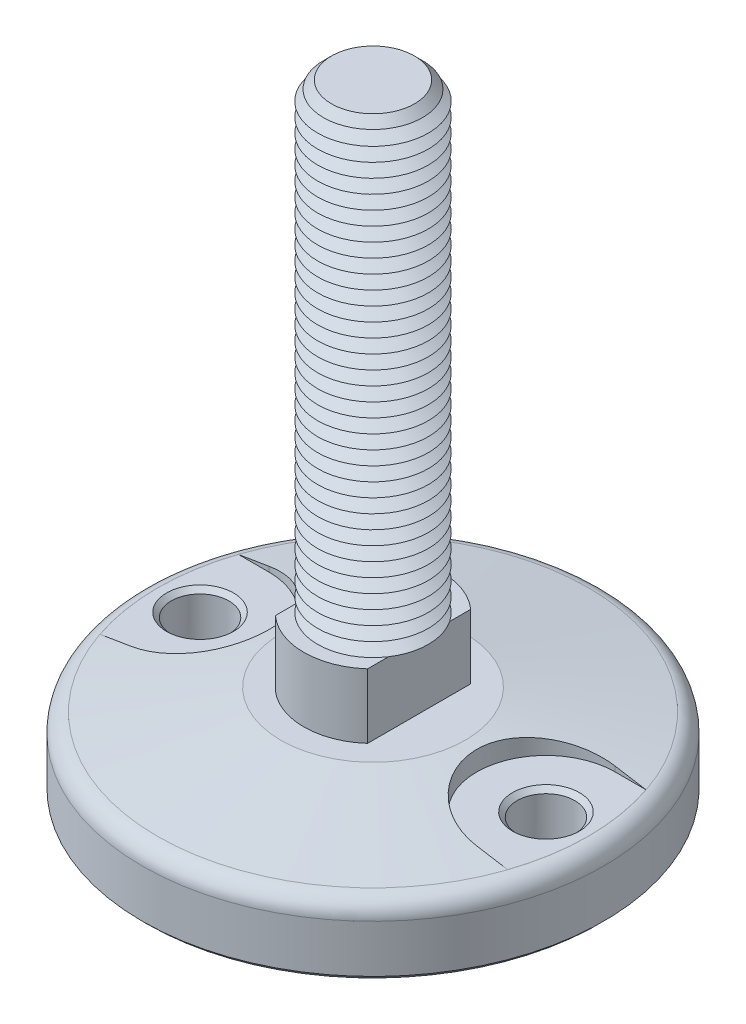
ISO-10303-21;
HEADER;
FILE_DESCRIPTION(('STEP AP214'),'2;1');
FILE_NAME('part.step','',(''),(''),'','','');
FILE_SCHEMA(('AUTOMOTIVE_DESIGN { 1 0 10303 214 1 1 1 1 }'));
ENDSEC;
DATA;
#1=APPLICATION_CONTEXT('core data for automotive mechanical design processes');
#2=APPLICATION_PROTOCOL_DEFINITION('international standard','automotive_design',2000,#1);
#3=PRODUCT_CONTEXT('',#1,'mechanical');
#4=PRODUCT('Part','Part','',(#3));
#5=PRODUCT_RELATED_PRODUCT_CATEGORY('part','',(#4));
#6=PRODUCT_DEFINITION_FORMATION('','',#4);
#7=PRODUCT_DEFINITION_CONTEXT('part definition',#1,'design');
#8=PRODUCT_DEFINITION('design','',#6,#7);
#9=PRODUCT_DEFINITION_SHAPE('','',#8);
#10=(LENGTH_UNIT() NAMED_UNIT(*) SI_UNIT(.MILLI.,.METRE.));
#11=(NAMED_UNIT(*) PLANE_ANGLE_UNIT() SI_UNIT($,.RADIAN.));
#12=(NAMED_UNIT(*) SI_UNIT($,.STERADIAN.) SOLID_ANGLE_UNIT());
#13=UNCERTAINTY_MEASURE_WITH_UNIT(LENGTH_MEASURE(1.E-05),#10,'distance_accuracy_value','');
#14=(GEOMETRIC_REPRESENTATION_CONTEXT(3) GLOBAL_UNCERTAINTY_ASSIGNED_CONTEXT((#13)) GLOBAL_UNIT_ASSIGNED_CONTEXT((#10,
#11,#12)) REPRESENTATION_CONTEXT('',''));
#15=CARTESIAN_POINT('',(0.,0.,0.));
#16=DIRECTION('',(0.,0.,1.));
#17=DIRECTION('',(1.,0.,0.));
#18=AXIS2_PLACEMENT_3D('',#15,#16,#17);
#19=CARTESIAN_POINT('',(0.,0.,0.));
#20=DIRECTION('',(0.,-1.,0.));
#21=DIRECTION('',(0.,0.,-1.));
#22=AXIS2_PLACEMENT_3D('',#19,#20,#21);
#23=CONICAL_SURFACE('',#22,20.,1.39626340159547);
#24=CARTESIAN_POINT('',(-37.5002,-3.59511701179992,14.9999999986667));
#25=CARTESIAN_POINT('',(-37.071618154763,-3.52495922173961,15.0000502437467));
#26=CARTESIAN_POINT('',(-36.6432161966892,-3.45377973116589,14.9816452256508));
#27=CARTESIAN_POINT('',(-35.7898597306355,-3.30975397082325,14.9083347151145));
#28=CARTESIAN_POINT('',(-35.3649049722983,-3.23690782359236,14.8534318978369));
#29=CARTESIAN_POINT('',(-34.5217702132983,-3.0899678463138,14.7075882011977));
#30=CARTESIAN_POINT('',(-34.1035855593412,-3.0158749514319,14.6166732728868));
#31=CARTESIAN_POINT('',(-33.276654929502,-2.86680950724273,14.3995164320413));
#32=CARTESIAN_POINT('',(-32.8679089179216,-2.79183696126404,14.2732746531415));
#33=CARTESIAN_POINT('',(-32.0626157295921,-2.64144796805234,13.9863372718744));
#34=CARTESIAN_POINT('',(-31.6660727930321,-2.56603137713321,13.8256298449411));
#35=CARTESIAN_POINT('',(-30.8881421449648,-2.41529591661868,13.4709346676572));
#36=CARTESIAN_POINT('',(-30.5067544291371,-2.33997704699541,13.276946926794));
#37=CARTESIAN_POINT('',(-29.7618852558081,-2.19002394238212,12.8570734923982));
#38=CARTESIAN_POINT('',(-29.3984015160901,-2.11538962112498,12.6311918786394));
#39=CARTESIAN_POINT('',(-28.6918747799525,-1.96744405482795,12.1490672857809));
#40=CARTESIAN_POINT('',(-28.348831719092,-1.89413280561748,11.8928244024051));
#41=CARTESIAN_POINT('',(-27.68528276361,-1.74948251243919,11.3514262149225));
#42=CARTESIAN_POINT('',(-27.3648018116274,-1.67814570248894,11.0662397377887));
#43=CARTESIAN_POINT('',(-26.7491189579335,-1.53834682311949,10.4691194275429));
#44=CARTESIAN_POINT('',(-26.4539171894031,-1.46988476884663,10.1571854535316));
#45=CARTESIAN_POINT('',(-25.89093801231,-1.33673920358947,9.50863296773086));
#46=CARTESIAN_POINT('',(-25.6231651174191,-1.27205631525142,9.17201040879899));
#47=CARTESIAN_POINT('',(-25.1171410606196,-1.14749043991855,8.47642452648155));
#48=CARTESIAN_POINT('',(-24.8788895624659,-1.08760739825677,8.11746145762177));
#49=CARTESIAN_POINT('',(-24.4362735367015,-0.974368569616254,7.38380225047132));
#50=CARTESIAN_POINT('',(-24.2315599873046,-0.920947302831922,7.00932682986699));
#51=CARTESIAN_POINT('',(-23.8544760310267,-0.820970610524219,6.24354239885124));
#52=CARTESIAN_POINT('',(-23.6821054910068,-0.774415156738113,5.85223345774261));
#53=CARTESIAN_POINT('',(-23.3712027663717,-0.689292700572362,5.05567287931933));
#54=CARTESIAN_POINT('',(-23.2326612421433,-0.650723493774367,4.65042512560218));
#55=CARTESIAN_POINT('',(-22.9905836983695,-0.582602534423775,3.82886542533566));
#56=CARTESIAN_POINT('',(-22.8870466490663,-0.553050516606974,3.41255380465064));
#57=CARTESIAN_POINT('',(-22.7185202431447,-0.504595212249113,2.58473472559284));
#58=CARTESIAN_POINT('',(-22.6524606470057,-0.485397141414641,2.17346220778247));
#59=CARTESIAN_POINT('',(-22.5547584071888,-0.456903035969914,1.34650988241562));
#60=CARTESIAN_POINT('',(-22.5231150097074,-0.447606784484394,0.930830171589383));
#61=CARTESIAN_POINT('',(-22.4945397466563,-0.43921477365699,0.0982343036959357));
#62=CARTESIAN_POINT('',(-22.4976030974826,-0.440117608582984,-0.318681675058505));
#63=CARTESIAN_POINT('',(-22.5384014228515,-0.452091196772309,-1.15066338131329));
#64=CARTESIAN_POINT('',(-22.5761359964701,-0.463161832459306,-1.56572913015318));
#65=CARTESIAN_POINT('',(-22.684465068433,-0.494692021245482,-2.37993589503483));
#66=CARTESIAN_POINT('',(-22.7541599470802,-0.514894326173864,-2.77920702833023));
#67=CARTESIAN_POINT('',(-22.9254719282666,-0.564017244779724,-3.57028216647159));
#68=CARTESIAN_POINT('',(-23.0270883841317,-0.592937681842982,-3.9620863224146));
#69=CARTESIAN_POINT('',(-23.2614195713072,-0.65873341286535,-4.7356274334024));
#70=CARTESIAN_POINT('',(-23.3941371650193,-0.695609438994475,-5.11736345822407));
#71=CARTESIAN_POINT('',(-23.6896243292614,-0.776432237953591,-5.86824656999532));
#72=CARTESIAN_POINT('',(-23.8523945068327,-0.820379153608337,-6.23739340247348));
#73=CARTESIAN_POINT('',(-24.2096654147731,-0.915179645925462,-6.96667519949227));
#74=CARTESIAN_POINT('',(-24.4046414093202,-0.966134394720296,-7.32656415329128));
#75=CARTESIAN_POINT('',(-24.8229317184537,-1.07340641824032,-8.02863083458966));
#76=CARTESIAN_POINT('',(-25.0462462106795,-1.12972372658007,-8.37080845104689));
#77=CARTESIAN_POINT('',(-25.5196353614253,-1.24678782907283,-9.03533577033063));
#78=CARTESIAN_POINT('',(-25.7697111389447,-1.30753480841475,-9.35768464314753));
#79=CARTESIAN_POINT('',(-26.2948980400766,-1.43258611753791,-9.98056367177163));
#80=CARTESIAN_POINT('',(-26.5700098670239,-1.4968905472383,-10.2810932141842));
#81=CARTESIAN_POINT('',(-27.1529305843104,-1.63043794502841,-10.8680655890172));
#82=CARTESIAN_POINT('',(-27.4615208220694,-1.69977394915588,-11.1537117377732));
#83=CARTESIAN_POINT('',(-28.101294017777,-1.84060155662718,-11.6978928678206));
#84=CARTESIAN_POINT('',(-28.4324776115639,-1.91209322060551,-11.9564270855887));
#85=CARTESIAN_POINT('',(-29.1152826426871,-2.05655312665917,-12.4447886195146));
#86=CARTESIAN_POINT('',(-29.4669124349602,-2.12952196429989,-12.6746040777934));
#87=CARTESIAN_POINT('',(-30.1880609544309,-2.27627325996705,-13.1038783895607));
#88=CARTESIAN_POINT('',(-30.5575792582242,-2.35005569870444,-13.303337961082));
#89=CARTESIAN_POINT('',(-31.3189196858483,-2.49923001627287,-13.6739446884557));
#90=CARTESIAN_POINT('',(-31.7110266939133,-2.5746265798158,-13.8445050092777));
#91=CARTESIAN_POINT('',(-32.5084114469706,-2.72514849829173,-14.1515569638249));
#92=CARTESIAN_POINT('',(-32.9136891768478,-2.80027385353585,-14.2880486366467));
#93=CARTESIAN_POINT('',(-33.7340205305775,-2.94968142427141,-14.5258238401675));
#94=CARTESIAN_POINT('',(-34.1490613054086,-3.02396457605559,-14.6271511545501));
#95=CARTESIAN_POINT('',(-34.9863081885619,-3.17132754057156,-14.7940335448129));
#96=CARTESIAN_POINT('',(-35.4085107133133,-3.24440792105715,-14.8596059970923));
#97=CARTESIAN_POINT('',(-36.1096790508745,-3.36387020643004,-14.9380274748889));
#98=CARTESIAN_POINT('',(-36.3874461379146,-3.41070654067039,-14.9612791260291));
#99=CARTESIAN_POINT('',(-36.943509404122,-3.50354098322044,-14.9922564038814));
#100=CARTESIAN_POINT('',(-37.2218039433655,-3.54954035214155,-15.0000076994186));
#101=CARTESIAN_POINT('',(-37.5002,-3.59511701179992,-14.9999999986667));
#102=B_SPLINE_CURVE_WITH_KNOTS('',3,(#24,#25,#26,#27,#28,#29,#30,#31,#32,#33,#34,#35,#36,#37,
#38,#39,#40,#41,#42,#43,#44,#45,#46,#47,#48,#49,#50,#51,#52,#53,#54,#55,#56,#57,#58,#59,#60,#61,
#62,#63,#64,#65,#66,#67,#68,#69,#70,#71,#72,#73,#74,#75,#76,#77,#78,#79,#80,#81,#82,#83,#84,#85,
#86,#87,#88,#89,#90,#91,#92,#93,#94,#95,#96,#97,#98,#99,#100,#101),.UNSPECIFIED.,.F.,.F.,(4,2,2,
2,2,2,2,2,2,2,2,2,2,2,2,2,2,2,2,2,2,2,2,2,2,2,2,2,2,2,2,2,2,2,2,2,2,2,4),(0.,1.30244924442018,
2.60480303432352,3.90622002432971,5.20763209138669,6.50949136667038,7.81135027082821,
9.11304279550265,10.4147312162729,11.7178367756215,13.0209491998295,14.3242757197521,
15.6275873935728,16.9163305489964,18.2050683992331,19.4934500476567,20.7817937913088,
22.0312084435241,23.2805957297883,24.5298108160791,25.779011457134,26.9950246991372,
28.2110133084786,29.4271138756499,30.6432390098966,31.8792469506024,33.1152626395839,
34.3513300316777,35.5874321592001,36.864491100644,38.1415859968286,39.4192064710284,
40.6967967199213,41.9978357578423,43.2988733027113,44.5982850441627,45.8970647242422,
46.7446059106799,47.590742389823),.UNSPECIFIED.);
#103=CARTESIAN_POINT('',(-37.5,-3.59508426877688,15.));
#104=VERTEX_POINT('',#103);
#105=CARTESIAN_POINT('',(-37.5,-3.59508426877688,-15.));
#106=VERTEX_POINT('',#105);
#107=EDGE_CURVE('E543',#104,#106,#102,.T.);
#108=ORIENTED_EDGE('',*,*,#107,.F.);
#109=CARTESIAN_POINT('',(-58.7331838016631,-7.16211468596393,15.));
#110=CARTESIAN_POINT('',(-57.4400366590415,-6.941199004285,15.));
#111=CARTESIAN_POINT('',(-56.1468183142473,-6.72069896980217,15.));
#112=CARTESIAN_POINT('',(-53.5602019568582,-6.2807555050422,15.));
#113=CARTESIAN_POINT('',(-52.2668039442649,-6.06131207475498,15.));
#114=CARTESIAN_POINT('',(-49.6798066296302,-5.62370977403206,15.));
#115=CARTESIAN_POINT('',(-48.3862073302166,-5.40555088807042,15.));
#116=CARTESIAN_POINT('',(-45.7987405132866,-4.97082983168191,15.));
#117=CARTESIAN_POINT('',(-44.5048729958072,-4.75426766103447,15.));
#118=CARTESIAN_POINT('',(-41.9167872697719,-4.32315417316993,15.));
#119=CARTESIAN_POINT('',(-40.6225690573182,-4.10860287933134,15.));
#120=CARTESIAN_POINT('',(-38.0337081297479,-3.68208609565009,15.));
#121=CARTESIAN_POINT('',(-36.7390654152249,-3.47012060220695,15.));
#122=CARTESIAN_POINT('',(-34.1492138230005,-3.04956665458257,15.));
#123=CARTESIAN_POINT('',(-32.854004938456,-2.84097824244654,15.));
#124=CARTESIAN_POINT('',(-30.9106470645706,-2.53149468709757,15.));
#125=CARTESIAN_POINT('',(-30.2627688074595,-2.4288997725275,15.));
#126=CARTESIAN_POINT('',(-28.9668013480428,-2.22504633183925,15.));
#127=CARTESIAN_POINT('',(-28.3187121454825,-2.12378780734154,15.));
#128=CARTESIAN_POINT('',(-27.6705030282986,-2.02329919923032,15.));
#129=B_SPLINE_CURVE_WITH_KNOTS('',3,(#109,#110,#111,#112,#113,#114,#115,#116,#117,#118,#119,
#120,#121,#122,#123,#124,#125,#126,#127,#128),.UNSPECIFIED.,.F.,.F.,(4,2,2,2,2,2,2,2,2,4),(0.,
3.93564494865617,7.87128985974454,11.8068871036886,15.7424838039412,19.6781262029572,
23.6137631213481,27.5494490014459,29.5173013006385,31.4851559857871),.UNSPECIFIED.);
#130=CARTESIAN_POINT('',(-44.1779505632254,-4.7,15.));
#131=VERTEX_POINT('',#130);
#132=EDGE_CURVE('E517',#131,#104,#129,.T.);
#133=ORIENTED_EDGE('',*,*,#132,.F.);
#134=CARTESIAN_POINT('',(0.,-4.7,0.));
#135=DIRECTION('',(0.,1.,0.));
#136=DIRECTION('',(0.,0.,1.));
#137=AXIS2_PLACEMENT_3D('',#134,#135,#136);
#138=CIRCLE('',#137,46.6550245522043);
#139=CARTESIAN_POINT('',(-44.1779505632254,-4.7,-15.));
#140=VERTEX_POINT('',#139);
#141=EDGE_CURVE('E501',#131,#140,#138,.F.);
#142=ORIENTED_EDGE('',*,*,#141,.T.);
#143=CARTESIAN_POINT('',(-27.6705030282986,-2.02329919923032,-15.));
#144=CARTESIAN_POINT('',(-28.3187121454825,-2.12378780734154,-15.));
#145=CARTESIAN_POINT('',(-28.9668013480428,-2.22504633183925,-15.));
#146=CARTESIAN_POINT('',(-30.2627688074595,-2.4288997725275,-15.));
#147=CARTESIAN_POINT('',(-30.9106470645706,-2.53149468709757,-15.));
#148=CARTESIAN_POINT('',(-32.854004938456,-2.84097824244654,-15.));
#149=CARTESIAN_POINT('',(-34.1492138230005,-3.04956665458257,-15.));
#150=CARTESIAN_POINT('',(-36.7390654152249,-3.47012060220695,-15.));
#151=CARTESIAN_POINT('',(-38.0337081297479,-3.68208609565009,-15.));
#152=CARTESIAN_POINT('',(-40.6225690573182,-4.10860287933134,-15.));
#153=CARTESIAN_POINT('',(-41.9167872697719,-4.32315417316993,-15.));
#154=CARTESIAN_POINT('',(-44.5048729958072,-4.75426766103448,-15.));
#155=CARTESIAN_POINT('',(-45.7987405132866,-4.97082983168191,-15.));
#156=CARTESIAN_POINT('',(-48.3862073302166,-5.40555088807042,-15.));
#157=CARTESIAN_POINT('',(-49.6798066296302,-5.62370977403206,-15.));
#158=CARTESIAN_POINT('',(-52.2668039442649,-6.06131207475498,-15.));
#159=CARTESIAN_POINT('',(-53.5602019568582,-6.2807555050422,-15.));
#160=CARTESIAN_POINT('',(-56.1468183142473,-6.72069896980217,-15.));
#161=CARTESIAN_POINT('',(-57.4400366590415,-6.941199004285,-15.));
#162=CARTESIAN_POINT('',(-58.7331838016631,-7.16211468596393,-15.));
#163=B_SPLINE_CURVE_WITH_KNOTS('',3,(#143,#144,#145,#146,#147,#148,#149,#150,#151,#152,#153,
#154,#155,#156,#157,#158,#159,#160,#161,#162),.UNSPECIFIED.,.F.,.F.,(4,2,2,2,2,2,2,2,2,4),(0.,
1.96785468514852,3.93570698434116,7.871392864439,11.8070297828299,15.7426721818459,
19.6782688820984,23.6138661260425,27.5495110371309,31.4851559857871),.UNSPECIFIED.);
#164=EDGE_CURVE('E509',#106,#140,#163,.T.);
#165=ORIENTED_EDGE('',*,*,#164,.F.);
#166=EDGE_LOOP('',(#108,#133,#142,#165));
#167=FACE_BOUND('',#166,.T.);
#168=CARTESIAN_POINT('',(0.,-4.70697693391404,0.));
#169=DIRECTION('',(0.,1.,0.));
#170=DIRECTION('',(0.,0.,1.));
#171=AXIS2_PLACEMENT_3D('',#168,#169,#170);
#172=CIRCLE('',#171,46.6945927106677);
#173=CARTESIAN_POINT('',(0.,-4.70697693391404,46.6945927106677));
#174=VERTEX_POINT('',#173);
#175=EDGE_CURVE('E490',#174,#174,#172,.T.);
#176=ORIENTED_EDGE('',*,*,#175,.T.);
#177=EDGE_LOOP('',(#176));
#178=FACE_BOUND('',#177,.T.);
#179=CARTESIAN_POINT('',(0.,0.,0.));
#180=DIRECTION('',(0.,1.,0.));
#181=DIRECTION('',(0.,0.,1.));
#182=AXIS2_PLACEMENT_3D('',#179,#180,#181);
#183=CIRCLE('',#182,20.);
#184=CARTESIAN_POINT('',(0.,0.,20.));
#185=VERTEX_POINT('',#184);
#186=EDGE_CURVE('E486',#185,#185,#183,.T.);
#187=ORIENTED_EDGE('',*,*,#186,.F.);
#188=EDGE_LOOP('',(#187));
#189=FACE_BOUND('',#188,.T.);
#190=CARTESIAN_POINT('',(53.8330700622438,-6.32728263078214,15.));
#191=CARTESIAN_POINT('',(52.5396994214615,-6.10761035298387,15.));
#192=CARTESIAN_POINT('',(51.2462390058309,-5.88846451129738,15.));
#193=CARTESIAN_POINT('',(48.6590869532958,-5.45154457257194,15.));
#194=CARTESIAN_POINT('',(47.3653953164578,-5.23377047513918,15.));
#195=CARTESIAN_POINT('',(44.7777592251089,-4.79991793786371,15.));
#196=CARTESIAN_POINT('',(43.4838147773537,-4.58383945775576,15.));
#197=CARTESIAN_POINT('',(40.8955691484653,-4.15382985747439,15.));
#198=CARTESIAN_POINT('',(39.6012679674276,-3.93989873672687,15.));
#199=CARTESIAN_POINT('',(37.0121780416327,-3.51480066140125,15.));
#200=CARTESIAN_POINT('',(35.7173892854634,-3.30363377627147,15.));
#201=CARTESIAN_POINT('',(33.1272261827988,-2.88493970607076,15.));
#202=CARTESIAN_POINT('',(31.8318518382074,-2.67741250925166,15.));
#203=CARTESIAN_POINT('',(29.8881899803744,-2.36980627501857,15.));
#204=CARTESIAN_POINT('',(29.2401942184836,-2.2678836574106,15.));
#205=CARTESIAN_POINT('',(27.9439769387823,-2.06548679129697,15.));
#206=CARTESIAN_POINT('',(27.2957554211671,-1.96501254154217,15.));
#207=CARTESIAN_POINT('',(25.9990437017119,-1.76576366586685,15.));
#208=CARTESIAN_POINT('',(25.3505534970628,-1.66698905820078,15.));
#209=CARTESIAN_POINT('',(24.0532646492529,-1.47147446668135,15.));
#210=CARTESIAN_POINT('',(23.4044660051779,-1.37473448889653,15.));
#211=CARTESIAN_POINT('',(22.7554917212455,-1.27917906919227,15.));
#212=B_SPLINE_CURVE_WITH_KNOTS('',3,(#190,#191,#192,#193,#194,#195,#196,#197,#198,#199,#200,
#201,#202,#203,#204,#205,#206,#207,#208,#209,#210,#211),.UNSPECIFIED.,.F.,.F.,(4,2,2,2,2,2,2,2,
2,2,4),(0.,3.93567975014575,7.87135837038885,11.806943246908,15.7425270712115,19.6782095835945,
23.6138793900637,25.5817654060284,27.5496497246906,29.5175551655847,31.4854664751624),.UNSPECIFIED.);
#213=CARTESIAN_POINT('',(44.1779505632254,-4.7,15.));
#214=VERTEX_POINT('',#213);
#215=CARTESIAN_POINT('',(37.5,-3.59508426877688,15.));
#216=VERTEX_POINT('',#215);
#217=EDGE_CURVE('E133',#214,#216,#212,.T.);
#218=ORIENTED_EDGE('',*,*,#217,.T.);
#219=CARTESIAN_POINT('',(37.5002,-3.59511701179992,14.9999999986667));
#220=CARTESIAN_POINT('',(37.071618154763,-3.52495922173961,15.0000502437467));
#221=CARTESIAN_POINT('',(36.6432161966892,-3.45377973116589,14.9816452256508));
#222=CARTESIAN_POINT('',(35.7898597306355,-3.30975397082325,14.9083347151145));
#223=CARTESIAN_POINT('',(35.3649049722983,-3.23690782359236,14.8534318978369));
#224=CARTESIAN_POINT('',(34.5217702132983,-3.0899678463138,14.7075882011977));
#225=CARTESIAN_POINT('',(34.1035855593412,-3.0158749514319,14.6166732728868));
#226=CARTESIAN_POINT('',(33.276654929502,-2.86680950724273,14.3995164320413));
#227=CARTESIAN_POINT('',(32.8679089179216,-2.79183696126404,14.2732746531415));
#228=CARTESIAN_POINT('',(32.0626157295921,-2.64144796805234,13.9863372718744));
#229=CARTESIAN_POINT('',(31.6660727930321,-2.56603137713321,13.8256298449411));
#230=CARTESIAN_POINT('',(30.8881421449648,-2.41529591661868,13.4709346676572));
#231=CARTESIAN_POINT('',(30.5067544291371,-2.33997704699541,13.276946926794));
#232=CARTESIAN_POINT('',(29.7618852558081,-2.19002394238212,12.8570734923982));
#233=CARTESIAN_POINT('',(29.3984015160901,-2.11538962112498,12.6311918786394));
#234=CARTESIAN_POINT('',(28.6918747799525,-1.96744405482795,12.1490672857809));
#235=CARTESIAN_POINT('',(28.348831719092,-1.89413280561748,11.8928244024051));
#236=CARTESIAN_POINT('',(27.68528276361,-1.74948251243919,11.3514262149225));
#237=CARTESIAN_POINT('',(27.3648018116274,-1.67814570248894,11.0662397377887));
#238=CARTESIAN_POINT('',(26.7491189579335,-1.53834682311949,10.4691194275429));
#239=CARTESIAN_POINT('',(26.4539171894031,-1.46988476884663,10.1571854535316));
#240=CARTESIAN_POINT('',(25.89093801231,-1.33673920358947,9.50863296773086));
#241=CARTESIAN_POINT('',(25.6231651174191,-1.27205631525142,9.17201040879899));
#242=CARTESIAN_POINT('',(25.1171410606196,-1.14749043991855,8.47642452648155));
#243=CARTESIAN_POINT('',(24.8788895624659,-1.08760739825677,8.11746145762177));
#244=CARTESIAN_POINT('',(24.4362735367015,-0.974368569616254,7.38380225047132));
#245=CARTESIAN_POINT('',(24.2315599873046,-0.920947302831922,7.00932682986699));
#246=CARTESIAN_POINT('',(23.8544760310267,-0.820970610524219,6.24354239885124));
#247=CARTESIAN_POINT('',(23.6821054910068,-0.774415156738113,5.85223345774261));
#248=CARTESIAN_POINT('',(23.3712027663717,-0.689292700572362,5.05567287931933));
#249=CARTESIAN_POINT('',(23.2326612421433,-0.650723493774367,4.65042512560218));
#250=CARTESIAN_POINT('',(22.9905836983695,-0.582602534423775,3.82886542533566));
#251=CARTESIAN_POINT('',(22.8870466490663,-0.553050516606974,3.41255380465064));
#252=CARTESIAN_POINT('',(22.7185202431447,-0.504595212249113,2.58473472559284));
#253=CARTESIAN_POINT('',(22.6524606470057,-0.485397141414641,2.17346220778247));
#254=CARTESIAN_POINT('',(22.5547584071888,-0.456903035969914,1.34650988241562));
#255=CARTESIAN_POINT('',(22.5231150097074,-0.447606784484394,0.930830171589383));
#256=CARTESIAN_POINT('',(22.4945397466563,-0.43921477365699,0.0982343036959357));
#257=CARTESIAN_POINT('',(22.4976030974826,-0.440117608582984,-0.318681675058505));
#258=CARTESIAN_POINT('',(22.5384014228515,-0.452091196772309,-1.15066338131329));
#259=CARTESIAN_POINT('',(22.5761359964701,-0.463161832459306,-1.56572913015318));
#260=CARTESIAN_POINT('',(22.684465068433,-0.494692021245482,-2.37993589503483));
#261=CARTESIAN_POINT('',(22.7541599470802,-0.514894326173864,-2.77920702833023));
#262=CARTESIAN_POINT('',(22.9254719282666,-0.564017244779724,-3.57028216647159));
#263=CARTESIAN_POINT('',(23.0270883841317,-0.592937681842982,-3.9620863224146));
#264=CARTESIAN_POINT('',(23.2614195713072,-0.65873341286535,-4.7356274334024));
#265=CARTESIAN_POINT('',(23.3941371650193,-0.695609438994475,-5.11736345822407));
#266=CARTESIAN_POINT('',(23.6896243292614,-0.776432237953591,-5.86824656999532));
#267=CARTESIAN_POINT('',(23.8523945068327,-0.820379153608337,-6.23739340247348));
#268=CARTESIAN_POINT('',(24.2096654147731,-0.915179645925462,-6.96667519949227));
#269=CARTESIAN_POINT('',(24.4046414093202,-0.966134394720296,-7.32656415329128));
#270=CARTESIAN_POINT('',(24.8229317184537,-1.07340641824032,-8.02863083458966));
#271=CARTESIAN_POINT('',(25.0462462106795,-1.12972372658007,-8.37080845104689));
#272=CARTESIAN_POINT('',(25.5196353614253,-1.24678782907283,-9.03533577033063));
#273=CARTESIAN_POINT('',(25.7697111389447,-1.30753480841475,-9.35768464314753));
#274=CARTESIAN_POINT('',(26.2948980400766,-1.43258611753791,-9.98056367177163));
#275=CARTESIAN_POINT('',(26.5700098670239,-1.4968905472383,-10.2810932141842));
#276=CARTESIAN_POINT('',(27.1529305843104,-1.63043794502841,-10.8680655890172));
#277=CARTESIAN_POINT('',(27.4615208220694,-1.69977394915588,-11.1537117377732));
#278=CARTESIAN_POINT('',(28.101294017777,-1.84060155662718,-11.6978928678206));
#279=CARTESIAN_POINT('',(28.4324776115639,-1.91209322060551,-11.9564270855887));
#280=CARTESIAN_POINT('',(29.1152826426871,-2.05655312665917,-12.4447886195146));
#281=CARTESIAN_POINT('',(29.4669124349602,-2.12952196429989,-12.6746040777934));
#282=CARTESIAN_POINT('',(30.1880609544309,-2.27627325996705,-13.1038783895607));
#283=CARTESIAN_POINT('',(30.5575792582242,-2.35005569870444,-13.303337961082));
#284=CARTESIAN_POINT('',(31.3189196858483,-2.49923001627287,-13.6739446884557));
#285=CARTESIAN_POINT('',(31.7110266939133,-2.5746265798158,-13.8445050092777));
#286=CARTESIAN_POINT('',(32.5084114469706,-2.72514849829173,-14.1515569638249));
#287=CARTESIAN_POINT('',(32.9136891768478,-2.80027385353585,-14.2880486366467));
#288=CARTESIAN_POINT('',(33.7340205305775,-2.94968142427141,-14.5258238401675));
#289=CARTESIAN_POINT('',(34.1490613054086,-3.02396457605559,-14.6271511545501));
#290=CARTESIAN_POINT('',(34.9863081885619,-3.17132754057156,-14.7940335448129));
#291=CARTESIAN_POINT('',(35.4085107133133,-3.24440792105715,-14.8596059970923));
#292=CARTESIAN_POINT('',(36.1096790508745,-3.36387020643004,-14.9380274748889));
#293=CARTESIAN_POINT('',(36.3874461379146,-3.41070654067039,-14.9612791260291));
#294=CARTESIAN_POINT('',(36.943509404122,-3.50354098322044,-14.9922564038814));
#295=CARTESIAN_POINT('',(37.2218039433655,-3.54954035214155,-15.0000076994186));
#296=CARTESIAN_POINT('',(37.5002,-3.59511701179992,-14.9999999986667));
#297=B_SPLINE_CURVE_WITH_KNOTS('',3,(#219,#220,#221,#222,#223,#224,#225,#226,#227,#228,#229,
#230,#231,#232,#233,#234,#235,#236,#237,#238,#239,#240,#241,#242,#243,#244,#245,#246,#247,#248,
#249,#250,#251,#252,#253,#254,#255,#256,#257,#258,#259,#260,#261,#262,#263,#264,#265,#266,#267,
#268,#269,#270,#271,#272,#273,#274,#275,#276,#277,#278,#279,#280,#281,#282,#283,#284,#285,#286,
#287,#288,#289,#290,#291,#292,#293,#294,#295,#296),.UNSPECIFIED.,.F.,.F.,(4,2,2,2,2,2,2,2,2,2,2,
2,2,2,2,2,2,2,2,2,2,2,2,2,2,2,2,2,2,2,2,2,2,2,2,2,2,2,4),(0.,1.30244924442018,2.60480303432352,
3.90622002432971,5.20763209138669,6.50949136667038,7.81135027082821,9.11304279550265,
10.4147312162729,11.7178367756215,13.0209491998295,14.3242757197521,15.6275873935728,
16.9163305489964,18.2050683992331,19.4934500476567,20.7817937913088,22.0312084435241,
23.2805957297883,24.5298108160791,25.779011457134,26.9950246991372,28.2110133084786,
29.4271138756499,30.6432390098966,31.8792469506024,33.1152626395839,34.3513300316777,
35.5874321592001,36.864491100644,38.1415859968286,39.4192064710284,40.6967967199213,
41.9978357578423,43.2988733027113,44.5982850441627,45.8970647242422,46.7446059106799,
47.590742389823),.UNSPECIFIED.);
#298=CARTESIAN_POINT('',(37.5,-3.59508426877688,-15.));
#299=VERTEX_POINT('',#298);
#300=EDGE_CURVE('E145',#216,#299,#297,.T.);
#301=ORIENTED_EDGE('',*,*,#300,.T.);
#302=CARTESIAN_POINT('',(22.7554917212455,-1.27917906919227,-15.));
#303=CARTESIAN_POINT('',(23.4044660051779,-1.37473448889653,-15.));
#304=CARTESIAN_POINT('',(24.0532646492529,-1.47147446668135,-15.));
#305=CARTESIAN_POINT('',(25.3505534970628,-1.66698905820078,-15.));
#306=CARTESIAN_POINT('',(25.9990437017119,-1.76576366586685,-15.));
#307=CARTESIAN_POINT('',(27.2957554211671,-1.96501254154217,-15.));
#308=CARTESIAN_POINT('',(27.9439769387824,-2.06548679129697,-15.));
#309=CARTESIAN_POINT('',(29.2401942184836,-2.2678836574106,-15.));
#310=CARTESIAN_POINT('',(29.8881899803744,-2.36980627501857,-15.));
#311=CARTESIAN_POINT('',(31.8318518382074,-2.67741250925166,-15.));
#312=CARTESIAN_POINT('',(33.1272261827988,-2.88493970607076,-15.));
#313=CARTESIAN_POINT('',(35.7173892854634,-3.30363377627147,-15.));
#314=CARTESIAN_POINT('',(37.0121780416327,-3.51480066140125,-15.));
#315=CARTESIAN_POINT('',(39.6012679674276,-3.93989873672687,-15.));
#316=CARTESIAN_POINT('',(40.8955691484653,-4.15382985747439,-15.));
#317=CARTESIAN_POINT('',(43.4838147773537,-4.58383945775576,-15.));
#318=CARTESIAN_POINT('',(44.7777592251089,-4.79991793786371,-15.));
#319=CARTESIAN_POINT('',(47.3653953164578,-5.23377047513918,-15.));
#320=CARTESIAN_POINT('',(48.6590869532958,-5.45154457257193,-15.));
#321=CARTESIAN_POINT('',(51.2462390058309,-5.88846451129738,-15.));
#322=CARTESIAN_POINT('',(52.5396994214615,-6.10761035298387,-15.));
#323=CARTESIAN_POINT('',(53.8330700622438,-6.32728263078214,-15.));
#324=B_SPLINE_CURVE_WITH_KNOTS('',3,(#302,#303,#304,#305,#306,#307,#308,#309,#310,#311,#312,
#313,#314,#315,#316,#317,#318,#319,#320,#321,#322,#323),.UNSPECIFIED.,.F.,.F.,(4,2,2,2,2,2,2,2,
2,2,4),(0.,1.96791130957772,3.93581675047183,5.90370106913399,7.8715870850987,11.8072568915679,
15.7429394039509,19.6785232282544,23.6141081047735,27.5497867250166,31.4854664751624),.UNSPECIFIED.);
#325=CARTESIAN_POINT('',(44.1779505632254,-4.7,-15.));
#326=VERTEX_POINT('',#325);
#327=EDGE_CURVE('E574',#299,#326,#324,.T.);
#328=ORIENTED_EDGE('',*,*,#327,.T.);
#329=CARTESIAN_POINT('',(0.,-4.7,0.));
#330=DIRECTION('',(0.,1.,0.));
#331=DIRECTION('',(0.,0.,1.));
#332=AXIS2_PLACEMENT_3D('',#329,#330,#331);
#333=CIRCLE('',#332,46.6550245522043);
#334=EDGE_CURVE('E565',#326,#214,#333,.F.);
#335=ORIENTED_EDGE('',*,*,#334,.T.);
#336=EDGE_LOOP('',(#218,#301,#328,#335));
#337=FACE_BOUND('',#336,.T.);
#338=ADVANCED_FACE('F39',(#167,#178,#189,#337),#23,.T.);
#339=CARTESIAN_POINT('',(0.,14.,0.));
#340=DIRECTION('',(0.,1.,0.));
#341=DIRECTION('',(0.,0.,1.));
#342=AXIS2_PLACEMENT_3D('',#339,#340,#341);
#343=PLANE('',#342);
#344=CARTESIAN_POINT('',(0.,14.,0.));
#345=DIRECTION('',(0.,1.,0.));
#346=DIRECTION('',(0.,0.,1.));
#347=AXIS2_PLACEMENT_3D('',#344,#345,#346);
#348=CIRCLE('',#347,12.);
#349=CARTESIAN_POINT('',(10.,14.,-6.6332495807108));
#350=VERTEX_POINT('',#349);
#351=CARTESIAN_POINT('',(-10.,14.,-6.6332495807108));
#352=VERTEX_POINT('',#351);
#353=EDGE_CURVE('E502',#350,#352,#348,.T.);
#354=ORIENTED_EDGE('',*,*,#353,.F.);
#355=DIRECTION('',(0.,0.,1.));
#356=VECTOR('',#355,1.);
#357=CARTESIAN_POINT('',(10.,14.,11.180339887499));
#358=LINE('',#357,#356);
#359=CARTESIAN_POINT('',(10.,14.,-11.1803398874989));
#360=VERTEX_POINT('',#359);
#361=EDGE_CURVE('E465',#360,#350,#358,.T.);
#362=ORIENTED_EDGE('',*,*,#361,.F.);
#363=CARTESIAN_POINT('',(0.,14.,0.));
#364=DIRECTION('',(0.,1.,0.));
#365=DIRECTION('',(0.,0.,1.));
#366=AXIS2_PLACEMENT_3D('',#363,#364,#365);
#367=CIRCLE('',#366,15.);
#368=CARTESIAN_POINT('',(-10.,14.,-11.180339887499));
#369=VERTEX_POINT('',#368);
#370=EDGE_CURVE('E479',#360,#369,#367,.T.);
#371=ORIENTED_EDGE('',*,*,#370,.T.);
#372=DIRECTION('',(0.,0.,-1.));
#373=VECTOR('',#372,1.);
#374=CARTESIAN_POINT('',(-10.,14.,-11.180339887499));
#375=LINE('',#374,#373);
#376=EDGE_CURVE('E452',#352,#369,#375,.T.);
#377=ORIENTED_EDGE('',*,*,#376,.F.);
#378=EDGE_LOOP('',(#354,#362,#371,#377));
#379=FACE_BOUND('',#378,.T.);
#380=ADVANCED_FACE('F628',(#379),#343,.T.);
#381=CARTESIAN_POINT('',(0.,14.,0.));
#382=DIRECTION('',(0.,-1.,0.));
#383=DIRECTION('',(0.,0.,-1.));
#384=AXIS2_PLACEMENT_3D('',#381,#382,#383);
#385=CYLINDRICAL_SURFACE('',#384,15.);
#386=CARTESIAN_POINT('',(-10.,14.,11.1803398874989));
#387=VERTEX_POINT('',#386);
#388=CARTESIAN_POINT('',(10.,14.,11.180339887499));
#389=VERTEX_POINT('',#388);
#390=EDGE_CURVE('E457',#387,#389,#367,.T.);
#391=ORIENTED_EDGE('',*,*,#390,.F.);
#392=DIRECTION('',(0.,1.,0.));
#393=VECTOR('',#392,1.);
#394=CARTESIAN_POINT('',(-10.,0.,11.180339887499));
#395=LINE('',#394,#393);
#396=CARTESIAN_POINT('',(-10.,0.,11.180339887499));
#397=VERTEX_POINT('',#396);
#398=EDGE_CURVE('E446',#397,#387,#395,.T.);
#399=ORIENTED_EDGE('',*,*,#398,.F.);
#400=CARTESIAN_POINT('',(0.,0.,0.));
#401=DIRECTION('',(0.,1.,0.));
#402=DIRECTION('',(0.,0.,1.));
#403=AXIS2_PLACEMENT_3D('',#400,#401,#402);
#404=CIRCLE('',#403,15.);
#405=CARTESIAN_POINT('',(10.,0.,11.180339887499));
#406=VERTEX_POINT('',#405);
#407=EDGE_CURVE('E480',#397,#406,#404,.T.);
#408=ORIENTED_EDGE('',*,*,#407,.T.);
#409=DIRECTION('',(0.,1.,0.));
#410=VECTOR('',#409,1.);
#411=CARTESIAN_POINT('',(10.,0.,11.180339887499));
#412=LINE('',#411,#410);
#413=EDGE_CURVE('E470',#406,#389,#412,.T.);
#414=ORIENTED_EDGE('',*,*,#413,.T.);
#415=EDGE_LOOP('',(#391,#399,#408,#414));
#416=FACE_BOUND('',#415,.T.);
#417=ADVANCED_FACE('F633',(#416),#385,.T.);
#418=CARTESIAN_POINT('',(0.,0.,0.));
#419=DIRECTION('',(0.,1.,0.));
#420=DIRECTION('',(0.,0.,1.));
#421=AXIS2_PLACEMENT_3D('',#418,#419,#420);
#422=PLANE('',#421);
#423=CARTESIAN_POINT('',(10.,0.,-11.180339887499));
#424=VERTEX_POINT('',#423);
#425=CARTESIAN_POINT('',(-10.,0.,-11.180339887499));
#426=VERTEX_POINT('',#425);
#427=EDGE_CURVE('E484',#424,#426,#404,.T.);
#428=ORIENTED_EDGE('',*,*,#427,.F.);
#429=DIRECTION('',(0.,0.,1.));
#430=VECTOR('',#429,1.);
#431=CARTESIAN_POINT('',(10.,0.,11.180339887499));
#432=LINE('',#431,#430);
#433=EDGE_CURVE('E460',#424,#406,#432,.T.);
#434=ORIENTED_EDGE('',*,*,#433,.T.);
#435=ORIENTED_EDGE('',*,*,#407,.F.);
#436=DIRECTION('',(0.,0.,-1.));
#437=VECTOR('',#436,1.);
#438=CARTESIAN_POINT('',(-10.,0.,-11.180339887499));
#439=LINE('',#438,#437);
#440=EDGE_CURVE('E442',#397,#426,#439,.T.);
#441=ORIENTED_EDGE('',*,*,#440,.T.);
#442=EDGE_LOOP('',(#428,#434,#435,#441));
#443=FACE_BOUND('',#442,.T.);
#444=ORIENTED_EDGE('',*,*,#186,.T.);
#445=EDGE_LOOP('',(#444));
#446=FACE_BOUND('',#445,.T.);
#447=ADVANCED_FACE('F775',(#443,#446),#422,.T.);
#448=CARTESIAN_POINT('',(0.,61.3388655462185,0.));
#449=DIRECTION('',(0.,1.,0.));
#450=DIRECTION('',(0.,0.,1.));
#451=AXIS2_PLACEMENT_3D('',#448,#449,#450);
#452=CYLINDRICAL_SURFACE('',#451,50.);
#453=CARTESIAN_POINT('',(0.,-19.,0.));
#454=DIRECTION('',(0.,-1.,0.));
#455=DIRECTION('',(0.,0.,-1.));
#456=AXIS2_PLACEMENT_3D('',#453,#454,#455);
#457=CIRCLE('',#456,50.);
#458=CARTESIAN_POINT('',(0.,-19.,-50.));
#459=VERTEX_POINT('',#458);
#460=EDGE_CURVE('E48',#459,#459,#457,.F.);
#461=ORIENTED_EDGE('',*,*,#460,.T.);
#462=EDGE_LOOP('',(#461));
#463=FACE_BOUND('',#462,.T.);
#464=CARTESIAN_POINT('',(0.,-8.64620794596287,0.));
#465=DIRECTION('',(0.,-1.,0.));
#466=DIRECTION('',(0.,0.,-1.));
#467=AXIS2_PLACEMENT_3D('',#464,#465,#466);
#468=CIRCLE('',#467,50.);
#469=CARTESIAN_POINT('',(0.,-8.64620794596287,-50.));
#470=VERTEX_POINT('',#469);
#471=EDGE_CURVE('E485',#470,#470,#468,.T.);
#472=ORIENTED_EDGE('',*,*,#471,.T.);
#473=EDGE_LOOP('',(#472));
#474=FACE_BOUND('',#473,.T.);
#475=ADVANCED_FACE('F615',(#463,#474),#452,.T.);
#476=CARTESIAN_POINT('',(0.,-20.,50.));
#477=DIRECTION('',(0.,-1.,0.));
#478=DIRECTION('',(0.,0.,-1.));
#479=AXIS2_PLACEMENT_3D('',#476,#477,#478);
#480=PLANE('',#479);
#481=CARTESIAN_POINT('',(0.,-20.,0.));
#482=DIRECTION('',(0.,-1.,0.));
#483=DIRECTION('',(0.,0.,-1.));
#484=AXIS2_PLACEMENT_3D('',#481,#482,#483);
#485=CIRCLE('',#484,49.);
#486=CARTESIAN_POINT('',(0.,-20.,-49.));
#487=VERTEX_POINT('',#486);
#488=EDGE_CURVE('E11',#487,#487,#485,.T.);
#489=ORIENTED_EDGE('',*,*,#488,.T.);
#490=EDGE_LOOP('',(#489));
#491=FACE_BOUND('',#490,.T.);
#492=CARTESIAN_POINT('',(37.5,-20.,0.));
#493=DIRECTION('',(0.,-1.,0.));
#494=DIRECTION('',(0.,0.,-1.));
#495=AXIS2_PLACEMENT_3D('',#492,#493,#494);
#496=CIRCLE('',#495,7.25000000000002);
#497=CARTESIAN_POINT('',(37.5,-20.,-7.25000000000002));
#498=VERTEX_POINT('',#497);
#499=EDGE_CURVE('E604',#498,#498,#496,.F.);
#500=ORIENTED_EDGE('',*,*,#499,.T.);
#501=EDGE_LOOP('',(#500));
#502=FACE_BOUND('',#501,.T.);
#503=CARTESIAN_POINT('',(-37.5,-20.,0.));
#504=DIRECTION('',(0.,-1.,0.));
#505=DIRECTION('',(0.,0.,-1.));
#506=AXIS2_PLACEMENT_3D('',#503,#504,#505);
#507=CIRCLE('',#506,7.24999999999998);
#508=CARTESIAN_POINT('',(-37.5,-20.,-7.24999999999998));
#509=VERTEX_POINT('',#508);
#510=EDGE_CURVE('E549',#509,#509,#507,.F.);
#511=ORIENTED_EDGE('',*,*,#510,.T.);
#512=EDGE_LOOP('',(#511));
#513=FACE_BOUND('',#512,.T.);
#514=ADVANCED_FACE('F759',(#491,#502,#513),#480,.T.);
#515=CARTESIAN_POINT('',(0.,-8.64620794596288,0.));
#516=DIRECTION('',(0.,-1.,0.));
#517=DIRECTION('',(0.,0.,-1.));
#518=AXIS2_PLACEMENT_3D('',#515,#516,#517);
#519=TOROIDAL_SURFACE('',#518,46.,4.);
#520=ORIENTED_EDGE('',*,*,#471,.F.);
#521=EDGE_LOOP('',(#520));
#522=FACE_BOUND('',#521,.T.);
#523=ORIENTED_EDGE('',*,*,#175,.F.);
#524=EDGE_LOOP('',(#523));
#525=FACE_BOUND('',#524,.T.);
#526=ADVANCED_FACE('F764',(#522,#525),#519,.T.);
#527=ORIENTED_EDGE('',*,*,#427,.T.);
#528=DIRECTION('',(0.,1.,0.));
#529=VECTOR('',#528,1.);
#530=CARTESIAN_POINT('',(-10.,0.,-11.180339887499));
#531=LINE('',#530,#529);
#532=EDGE_CURVE('E453',#426,#369,#531,.T.);
#533=ORIENTED_EDGE('',*,*,#532,.T.);
#534=ORIENTED_EDGE('',*,*,#370,.F.);
#535=DIRECTION('',(0.,1.,0.));
#536=VECTOR('',#535,1.);
#537=CARTESIAN_POINT('',(10.,0.,-11.180339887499));
#538=LINE('',#537,#536);
#539=EDGE_CURVE('E464',#424,#360,#538,.T.);
#540=ORIENTED_EDGE('',*,*,#539,.F.);
#541=EDGE_LOOP('',(#527,#533,#534,#540));
#542=FACE_BOUND('',#541,.T.);
#543=ADVANCED_FACE('F681',(#542),#385,.T.);
#544=CARTESIAN_POINT('',(-10.,14.,6.6332495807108));
#545=VERTEX_POINT('',#544);
#546=CARTESIAN_POINT('',(10.,14.,6.6332495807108));
#547=VERTEX_POINT('',#546);
#548=EDGE_CURVE('E441',#545,#547,#348,.T.);
#549=ORIENTED_EDGE('',*,*,#548,.F.);
#550=EDGE_CURVE('E447',#387,#545,#375,.T.);
#551=ORIENTED_EDGE('',*,*,#550,.F.);
#552=ORIENTED_EDGE('',*,*,#390,.T.);
#553=EDGE_CURVE('E440',#547,#389,#358,.T.);
#554=ORIENTED_EDGE('',*,*,#553,.F.);
#555=EDGE_LOOP('',(#549,#551,#552,#554));
#556=FACE_BOUND('',#555,.T.);
#557=ADVANCED_FACE('F636',(#556),#343,.T.);
#558=CARTESIAN_POINT('',(10.,0.,11.180339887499));
#559=DIRECTION('',(-1.,0.,0.));
#560=DIRECTION('',(0.,0.,1.));
#561=AXIS2_PLACEMENT_3D('',#558,#559,#560);
#562=PLANE('',#561);
#563=ORIENTED_EDGE('',*,*,#361,.T.);
#564=EDGE_CURVE('E469',#350,#547,#358,.T.);
#565=ORIENTED_EDGE('',*,*,#564,.T.);
#566=ORIENTED_EDGE('',*,*,#553,.T.);
#567=ORIENTED_EDGE('',*,*,#413,.F.);
#568=ORIENTED_EDGE('',*,*,#433,.F.);
#569=ORIENTED_EDGE('',*,*,#539,.T.);
#570=EDGE_LOOP('',(#563,#565,#566,#567,#568,#569));
#571=FACE_BOUND('',#570,.T.);
#572=ADVANCED_FACE('F657',(#571),#562,.F.);
#573=CARTESIAN_POINT('',(-10.,0.,-11.180339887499));
#574=DIRECTION('',(1.,0.,0.));
#575=DIRECTION('',(0.,0.,-1.));
#576=AXIS2_PLACEMENT_3D('',#573,#574,#575);
#577=PLANE('',#576);
#578=ORIENTED_EDGE('',*,*,#550,.T.);
#579=EDGE_CURVE('E451',#545,#352,#375,.T.);
#580=ORIENTED_EDGE('',*,*,#579,.T.);
#581=ORIENTED_EDGE('',*,*,#376,.T.);
#582=ORIENTED_EDGE('',*,*,#532,.F.);
#583=ORIENTED_EDGE('',*,*,#440,.F.);
#584=ORIENTED_EDGE('',*,*,#398,.T.);
#585=EDGE_LOOP('',(#578,#580,#581,#582,#583,#584));
#586=FACE_BOUND('',#585,.T.);
#587=ADVANCED_FACE('F670',(#586),#577,.F.);
#588=CARTESIAN_POINT('',(0.,14.,0.));
#589=DIRECTION('',(0.,1.,0.));
#590=DIRECTION('',(0.,0.,1.));
#591=AXIS2_PLACEMENT_3D('',#588,#589,#590);
#592=PLANE('',#591);
#593=ORIENTED_EDGE('',*,*,#579,.F.);
#594=EDGE_CURVE('E436',#352,#545,#348,.T.);
#595=ORIENTED_EDGE('',*,*,#594,.F.);
#596=EDGE_LOOP('',(#593,#595));
#597=FACE_BOUND('',#596,.T.);
#598=ADVANCED_FACE('F673',(#597),#592,.F.);
#599=ORIENTED_EDGE('',*,*,#564,.F.);
#600=EDGE_CURVE('E437',#547,#350,#348,.T.);
#601=ORIENTED_EDGE('',*,*,#600,.F.);
#602=EDGE_LOOP('',(#599,#601));
#603=FACE_BOUND('',#602,.T.);
#604=ADVANCED_FACE('F686',(#603),#592,.F.);
#605=CARTESIAN_POINT('',(0.,14.,0.));
#606=DIRECTION('',(0.,-1.,0.));
#607=DIRECTION('',(0.,0.,-1.));
#608=AXIS2_PLACEMENT_3D('',#605,#606,#607);
#609=CONICAL_SURFACE('',#608,12.,1.0471975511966);
#610=CARTESIAN_POINT('',(0.,15.5,0.));
#611=DIRECTION('',(0.,1.,0.));
#612=DIRECTION('',(0.,0.,1.));
#613=AXIS2_PLACEMENT_3D('',#610,#611,#612);
#614=CIRCLE('',#613,9.40192378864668);
#615=CARTESIAN_POINT('',(0.,15.5,9.40192378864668));
#616=VERTEX_POINT('',#615);
#617=EDGE_CURVE('E432',#616,#616,#614,.T.);
#618=ORIENTED_EDGE('',*,*,#617,.F.);
#619=EDGE_LOOP('',(#618));
#620=FACE_BOUND('',#619,.T.);
#621=ORIENTED_EDGE('',*,*,#600,.T.);
#622=ORIENTED_EDGE('',*,*,#353,.T.);
#623=ORIENTED_EDGE('',*,*,#594,.T.);
#624=ORIENTED_EDGE('',*,*,#548,.T.);
#625=EDGE_LOOP('',(#621,#622,#623,#624));
#626=FACE_BOUND('',#625,.T.);
#627=ADVANCED_FACE('F688',(#620,#626),#609,.T.);
#628=CARTESIAN_POINT('',(0.,15.5,0.));
#629=DIRECTION('',(0.,1.,0.));
#630=DIRECTION('',(0.,0.,1.));
#631=AXIS2_PLACEMENT_3D('',#628,#629,#630);
#632=CONICAL_SURFACE('',#631,9.40192378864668,1.0471975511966);
#633=CARTESIAN_POINT('',(0.,17.,0.));
#634=DIRECTION('',(0.,1.,0.));
#635=DIRECTION('',(0.,0.,1.));
#636=AXIS2_PLACEMENT_3D('',#633,#634,#635);
#637=CIRCLE('',#636,12.);
#638=CARTESIAN_POINT('',(0.,17.,12.));
#639=VERTEX_POINT('',#638);
#640=EDGE_CURVE('E428',#639,#639,#637,.T.);
#641=ORIENTED_EDGE('',*,*,#640,.F.);
#642=EDGE_LOOP('',(#641));
#643=FACE_BOUND('',#642,.T.);
#644=ORIENTED_EDGE('',*,*,#617,.T.);
#645=EDGE_LOOP('',(#644));
#646=FACE_BOUND('',#645,.T.);
#647=ADVANCED_FACE('F1456',(#643,#646),#632,.T.);
#648=CARTESIAN_POINT('',(0.,17.,0.));
#649=DIRECTION('',(0.,-1.,0.));
#650=DIRECTION('',(0.,0.,-1.));
#651=AXIS2_PLACEMENT_3D('',#648,#649,#650);
#652=CONICAL_SURFACE('',#651,12.,1.0471975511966);
#653=CARTESIAN_POINT('',(0.,18.5,0.));
#654=DIRECTION('',(0.,1.,0.));
#655=DIRECTION('',(0.,0.,1.));
#656=AXIS2_PLACEMENT_3D('',#653,#654,#655);
#657=CIRCLE('',#656,9.40192378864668);
#658=CARTESIAN_POINT('',(0.,18.5,9.40192378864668));
#659=VERTEX_POINT('',#658);
#660=EDGE_CURVE('E424',#659,#659,#657,.T.);
#661=ORIENTED_EDGE('',*,*,#660,.F.);
#662=EDGE_LOOP('',(#661));
#663=FACE_BOUND('',#662,.T.);
#664=ORIENTED_EDGE('',*,*,#640,.T.);
#665=EDGE_LOOP('',(#664));
#666=FACE_BOUND('',#665,.T.);
#667=ADVANCED_FACE('F1447',(#663,#666),#652,.T.);
#668=CARTESIAN_POINT('',(0.,18.5,0.));
#669=DIRECTION('',(0.,1.,0.));
#670=DIRECTION('',(0.,0.,1.));
#671=AXIS2_PLACEMENT_3D('',#668,#669,#670);
#672=CONICAL_SURFACE('',#671,9.40192378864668,1.0471975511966);
#673=CARTESIAN_POINT('',(0.,20.,0.));
#674=DIRECTION('',(0.,1.,0.));
#675=DIRECTION('',(0.,0.,1.));
#676=AXIS2_PLACEMENT_3D('',#673,#674,#675);
#677=CIRCLE('',#676,12.);
#678=CARTESIAN_POINT('',(0.,20.,12.));
#679=VERTEX_POINT('',#678);
#680=EDGE_CURVE('E420',#679,#679,#677,.T.);
#681=ORIENTED_EDGE('',*,*,#680,.F.);
#682=EDGE_LOOP('',(#681));
#683=FACE_BOUND('',#682,.T.);
#684=ORIENTED_EDGE('',*,*,#660,.T.);
#685=EDGE_LOOP('',(#684));
#686=FACE_BOUND('',#685,.T.);
#687=ADVANCED_FACE('F1438',(#683,#686),#672,.T.);
#688=CARTESIAN_POINT('',(0.,20.,0.));
#689=DIRECTION('',(0.,-1.,0.));
#690=DIRECTION('',(0.,0.,-1.));
#691=AXIS2_PLACEMENT_3D('',#688,#689,#690);
#692=CONICAL_SURFACE('',#691,12.,1.0471975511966);
#693=CARTESIAN_POINT('',(0.,21.5,0.));
#694=DIRECTION('',(0.,1.,0.));
#695=DIRECTION('',(0.,0.,1.));
#696=AXIS2_PLACEMENT_3D('',#693,#694,#695);
#697=CIRCLE('',#696,9.40192378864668);
#698=CARTESIAN_POINT('',(0.,21.5,9.40192378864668));
#699=VERTEX_POINT('',#698);
#700=EDGE_CURVE('E416',#699,#699,#697,.T.);
#701=ORIENTED_EDGE('',*,*,#700,.F.);
#702=EDGE_LOOP('',(#701));
#703=FACE_BOUND('',#702,.T.);
#704=ORIENTED_EDGE('',*,*,#680,.T.);
#705=EDGE_LOOP('',(#704));
#706=FACE_BOUND('',#705,.T.);
#707=ADVANCED_FACE('F1429',(#703,#706),#692,.T.);
#708=CARTESIAN_POINT('',(0.,21.5,0.));
#709=DIRECTION('',(0.,1.,0.));
#710=DIRECTION('',(0.,0.,1.));
#711=AXIS2_PLACEMENT_3D('',#708,#709,#710);
#712=CONICAL_SURFACE('',#711,9.40192378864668,1.0471975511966);
#713=CARTESIAN_POINT('',(0.,23.,0.));
#714=DIRECTION('',(0.,1.,0.));
#715=DIRECTION('',(0.,0.,1.));
#716=AXIS2_PLACEMENT_3D('',#713,#714,#715);
#717=CIRCLE('',#716,12.);
#718=CARTESIAN_POINT('',(0.,23.,12.));
#719=VERTEX_POINT('',#718);
#720=EDGE_CURVE('E412',#719,#719,#717,.T.);
#721=ORIENTED_EDGE('',*,*,#720,.F.);
#722=EDGE_LOOP('',(#721));
#723=FACE_BOUND('',#722,.T.);
#724=ORIENTED_EDGE('',*,*,#700,.T.);
#725=EDGE_LOOP('',(#724));
#726=FACE_BOUND('',#725,.T.);
#727=ADVANCED_FACE('F1420',(#723,#726),#712,.T.);
#728=CARTESIAN_POINT('',(0.,23.,0.));
#729=DIRECTION('',(0.,-1.,0.));
#730=DIRECTION('',(0.,0.,-1.));
#731=AXIS2_PLACEMENT_3D('',#728,#729,#730);
#732=CONICAL_SURFACE('',#731,12.,1.0471975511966);
#733=CARTESIAN_POINT('',(0.,24.5,0.));
#734=DIRECTION('',(0.,1.,0.));
#735=DIRECTION('',(0.,0.,1.));
#736=AXIS2_PLACEMENT_3D('',#733,#734,#735);
#737=CIRCLE('',#736,9.40192378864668);
#738=CARTESIAN_POINT('',(0.,24.5,9.40192378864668));
#739=VERTEX_POINT('',#738);
#740=EDGE_CURVE('E408',#739,#739,#737,.T.);
#741=ORIENTED_EDGE('',*,*,#740,.F.);
#742=EDGE_LOOP('',(#741));
#743=FACE_BOUND('',#742,.T.);
#744=ORIENTED_EDGE('',*,*,#720,.T.);
#745=EDGE_LOOP('',(#744));
#746=FACE_BOUND('',#745,.T.);
#747=ADVANCED_FACE('F1411',(#743,#746),#732,.T.);
#748=CARTESIAN_POINT('',(0.,24.5,0.));
#749=DIRECTION('',(0.,1.,0.));
#750=DIRECTION('',(0.,0.,1.));
#751=AXIS2_PLACEMENT_3D('',#748,#749,#750);
#752=CONICAL_SURFACE('',#751,9.40192378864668,1.0471975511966);
#753=CARTESIAN_POINT('',(0.,26.,0.));
#754=DIRECTION('',(0.,1.,0.));
#755=DIRECTION('',(0.,0.,1.));
#756=AXIS2_PLACEMENT_3D('',#753,#754,#755);
#757=CIRCLE('',#756,12.);
#758=CARTESIAN_POINT('',(0.,26.,12.));
#759=VERTEX_POINT('',#758);
#760=EDGE_CURVE('E404',#759,#759,#757,.T.);
#761=ORIENTED_EDGE('',*,*,#760,.F.);
#762=EDGE_LOOP('',(#761));
#763=FACE_BOUND('',#762,.T.);
#764=ORIENTED_EDGE('',*,*,#740,.T.);
#765=EDGE_LOOP('',(#764));
#766=FACE_BOUND('',#765,.T.);
#767=ADVANCED_FACE('F1402',(#763,#766),#752,.T.);
#768=CARTESIAN_POINT('',(0.,26.,0.));
#769=DIRECTION('',(0.,-1.,0.));
#770=DIRECTION('',(0.,0.,-1.));
#771=AXIS2_PLACEMENT_3D('',#768,#769,#770);
#772=CONICAL_SURFACE('',#771,12.,1.0471975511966);
#773=CARTESIAN_POINT('',(0.,27.5,0.));
#774=DIRECTION('',(0.,1.,0.));
#775=DIRECTION('',(0.,0.,1.));
#776=AXIS2_PLACEMENT_3D('',#773,#774,#775);
#777=CIRCLE('',#776,9.40192378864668);
#778=CARTESIAN_POINT('',(0.,27.5,9.40192378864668));
#779=VERTEX_POINT('',#778);
#780=EDGE_CURVE('E400',#779,#779,#777,.T.);
#781=ORIENTED_EDGE('',*,*,#780,.F.);
#782=EDGE_LOOP('',(#781));
#783=FACE_BOUND('',#782,.T.);
#784=ORIENTED_EDGE('',*,*,#760,.T.);
#785=EDGE_LOOP('',(#784));
#786=FACE_BOUND('',#785,.T.);
#787=ADVANCED_FACE('F1393',(#783,#786),#772,.T.);
#788=CARTESIAN_POINT('',(0.,27.5,0.));
#789=DIRECTION('',(0.,1.,0.));
#790=DIRECTION('',(0.,0.,1.));
#791=AXIS2_PLACEMENT_3D('',#788,#789,#790);
#792=CONICAL_SURFACE('',#791,9.40192378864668,1.0471975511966);
#793=CARTESIAN_POINT('',(0.,29.,0.));
#794=DIRECTION('',(0.,1.,0.));
#795=DIRECTION('',(0.,0.,1.));
#796=AXIS2_PLACEMENT_3D('',#793,#794,#795);
#797=CIRCLE('',#796,12.);
#798=CARTESIAN_POINT('',(0.,29.,12.));
#799=VERTEX_POINT('',#798);
#800=EDGE_CURVE('E396',#799,#799,#797,.T.);
#801=ORIENTED_EDGE('',*,*,#800,.F.);
#802=EDGE_LOOP('',(#801));
#803=FACE_BOUND('',#802,.T.);
#804=ORIENTED_EDGE('',*,*,#780,.T.);
#805=EDGE_LOOP('',(#804));
#806=FACE_BOUND('',#805,.T.);
#807=ADVANCED_FACE('F1384',(#803,#806),#792,.T.);
#808=CARTESIAN_POINT('',(0.,29.,0.));
#809=DIRECTION('',(0.,-1.,0.));
#810=DIRECTION('',(0.,0.,-1.));
#811=AXIS2_PLACEMENT_3D('',#808,#809,#810);
#812=CONICAL_SURFACE('',#811,12.,1.0471975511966);
#813=CARTESIAN_POINT('',(0.,30.5,0.));
#814=DIRECTION('',(0.,1.,0.));
#815=DIRECTION('',(0.,0.,1.));
#816=AXIS2_PLACEMENT_3D('',#813,#814,#815);
#817=CIRCLE('',#816,9.40192378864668);
#818=CARTESIAN_POINT('',(0.,30.5,9.40192378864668));
#819=VERTEX_POINT('',#818);
#820=EDGE_CURVE('E392',#819,#819,#817,.T.);
#821=ORIENTED_EDGE('',*,*,#820,.F.);
#822=EDGE_LOOP('',(#821));
#823=FACE_BOUND('',#822,.T.);
#824=ORIENTED_EDGE('',*,*,#800,.T.);
#825=EDGE_LOOP('',(#824));
#826=FACE_BOUND('',#825,.T.);
#827=ADVANCED_FACE('F1375',(#823,#826),#812,.T.);
#828=CARTESIAN_POINT('',(0.,30.5,0.));
#829=DIRECTION('',(0.,1.,0.));
#830=DIRECTION('',(0.,0.,1.));
#831=AXIS2_PLACEMENT_3D('',#828,#829,#830);
#832=CONICAL_SURFACE('',#831,9.40192378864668,1.0471975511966);
#833=CARTESIAN_POINT('',(0.,32.,0.));
#834=DIRECTION('',(0.,1.,0.));
#835=DIRECTION('',(0.,0.,1.));
#836=AXIS2_PLACEMENT_3D('',#833,#834,#835);
#837=CIRCLE('',#836,12.);
#838=CARTESIAN_POINT('',(0.,32.,12.));
#839=VERTEX_POINT('',#838);
#840=EDGE_CURVE('E388',#839,#839,#837,.T.);
#841=ORIENTED_EDGE('',*,*,#840,.F.);
#842=EDGE_LOOP('',(#841));
#843=FACE_BOUND('',#842,.T.);
#844=ORIENTED_EDGE('',*,*,#820,.T.);
#845=EDGE_LOOP('',(#844));
#846=FACE_BOUND('',#845,.T.);
#847=ADVANCED_FACE('F1366',(#843,#846),#832,.T.);
#848=CARTESIAN_POINT('',(0.,32.,0.));
#849=DIRECTION('',(0.,-1.,0.));
#850=DIRECTION('',(0.,0.,-1.));
#851=AXIS2_PLACEMENT_3D('',#848,#849,#850);
#852=CONICAL_SURFACE('',#851,12.,1.0471975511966);
#853=CARTESIAN_POINT('',(0.,33.5,0.));
#854=DIRECTION('',(0.,1.,0.));
#855=DIRECTION('',(0.,0.,1.));
#856=AXIS2_PLACEMENT_3D('',#853,#854,#855);
#857=CIRCLE('',#856,9.40192378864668);
#858=CARTESIAN_POINT('',(0.,33.5,9.40192378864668));
#859=VERTEX_POINT('',#858);
#860=EDGE_CURVE('E384',#859,#859,#857,.T.);
#861=ORIENTED_EDGE('',*,*,#860,.F.);
#862=EDGE_LOOP('',(#861));
#863=FACE_BOUND('',#862,.T.);
#864=ORIENTED_EDGE('',*,*,#840,.T.);
#865=EDGE_LOOP('',(#864));
#866=FACE_BOUND('',#865,.T.);
#867=ADVANCED_FACE('F1357',(#863,#866),#852,.T.);
#868=CARTESIAN_POINT('',(0.,33.5,0.));
#869=DIRECTION('',(0.,1.,0.));
#870=DIRECTION('',(0.,0.,1.));
#871=AXIS2_PLACEMENT_3D('',#868,#869,#870);
#872=CONICAL_SURFACE('',#871,9.40192378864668,1.0471975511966);
#873=CARTESIAN_POINT('',(0.,35.,0.));
#874=DIRECTION('',(0.,1.,0.));
#875=DIRECTION('',(0.,0.,1.));
#876=AXIS2_PLACEMENT_3D('',#873,#874,#875);
#877=CIRCLE('',#876,12.);
#878=CARTESIAN_POINT('',(0.,35.,12.));
#879=VERTEX_POINT('',#878);
#880=EDGE_CURVE('E380',#879,#879,#877,.T.);
#881=ORIENTED_EDGE('',*,*,#880,.F.);
#882=EDGE_LOOP('',(#881));
#883=FACE_BOUND('',#882,.T.);
#884=ORIENTED_EDGE('',*,*,#860,.T.);
#885=EDGE_LOOP('',(#884));
#886=FACE_BOUND('',#885,.T.);
#887=ADVANCED_FACE('F1348',(#883,#886),#872,.T.);
#888=CARTESIAN_POINT('',(0.,35.,0.));
#889=DIRECTION('',(0.,-1.,0.));
#890=DIRECTION('',(0.,0.,-1.));
#891=AXIS2_PLACEMENT_3D('',#888,#889,#890);
#892=CONICAL_SURFACE('',#891,12.,1.0471975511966);
#893=CARTESIAN_POINT('',(0.,36.5,0.));
#894=DIRECTION('',(0.,1.,0.));
#895=DIRECTION('',(0.,0.,1.));
#896=AXIS2_PLACEMENT_3D('',#893,#894,#895);
#897=CIRCLE('',#896,9.40192378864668);
#898=CARTESIAN_POINT('',(0.,36.5,9.40192378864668));
#899=VERTEX_POINT('',#898);
#900=EDGE_CURVE('E376',#899,#899,#897,.T.);
#901=ORIENTED_EDGE('',*,*,#900,.F.);
#902=EDGE_LOOP('',(#901));
#903=FACE_BOUND('',#902,.T.);
#904=ORIENTED_EDGE('',*,*,#880,.T.);
#905=EDGE_LOOP('',(#904));
#906=FACE_BOUND('',#905,.T.);
#907=ADVANCED_FACE('F1339',(#903,#906),#892,.T.);
#908=CARTESIAN_POINT('',(0.,36.5,0.));
#909=DIRECTION('',(0.,1.,0.));
#910=DIRECTION('',(0.,0.,1.));
#911=AXIS2_PLACEMENT_3D('',#908,#909,#910);
#912=CONICAL_SURFACE('',#911,9.40192378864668,1.0471975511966);
#913=CARTESIAN_POINT('',(0.,38.,0.));
#914=DIRECTION('',(0.,1.,0.));
#915=DIRECTION('',(0.,0.,1.));
#916=AXIS2_PLACEMENT_3D('',#913,#914,#915);
#917=CIRCLE('',#916,12.);
#918=CARTESIAN_POINT('',(0.,38.,12.));
#919=VERTEX_POINT('',#918);
#920=EDGE_CURVE('E372',#919,#919,#917,.T.);
#921=ORIENTED_EDGE('',*,*,#920,.F.);
#922=EDGE_LOOP('',(#921));
#923=FACE_BOUND('',#922,.T.);
#924=ORIENTED_EDGE('',*,*,#900,.T.);
#925=EDGE_LOOP('',(#924));
#926=FACE_BOUND('',#925,.T.);
#927=ADVANCED_FACE('F1330',(#923,#926),#912,.T.);
#928=CARTESIAN_POINT('',(0.,38.,0.));
#929=DIRECTION('',(0.,-1.,0.));
#930=DIRECTION('',(0.,0.,-1.));
#931=AXIS2_PLACEMENT_3D('',#928,#929,#930);
#932=CONICAL_SURFACE('',#931,12.,1.0471975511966);
#933=CARTESIAN_POINT('',(0.,39.5,0.));
#934=DIRECTION('',(0.,1.,0.));
#935=DIRECTION('',(0.,0.,1.));
#936=AXIS2_PLACEMENT_3D('',#933,#934,#935);
#937=CIRCLE('',#936,9.40192378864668);
#938=CARTESIAN_POINT('',(0.,39.5,9.40192378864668));
#939=VERTEX_POINT('',#938);
#940=EDGE_CURVE('E368',#939,#939,#937,.T.);
#941=ORIENTED_EDGE('',*,*,#940,.F.);
#942=EDGE_LOOP('',(#941));
#943=FACE_BOUND('',#942,.T.);
#944=ORIENTED_EDGE('',*,*,#920,.T.);
#945=EDGE_LOOP('',(#944));
#946=FACE_BOUND('',#945,.T.);
#947=ADVANCED_FACE('F1321',(#943,#946),#932,.T.);
#948=CARTESIAN_POINT('',(0.,39.5,0.));
#949=DIRECTION('',(0.,1.,0.));
#950=DIRECTION('',(0.,0.,1.));
#951=AXIS2_PLACEMENT_3D('',#948,#949,#950);
#952=CONICAL_SURFACE('',#951,9.40192378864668,1.0471975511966);
#953=CARTESIAN_POINT('',(0.,41.,0.));
#954=DIRECTION('',(0.,1.,0.));
#955=DIRECTION('',(0.,0.,1.));
#956=AXIS2_PLACEMENT_3D('',#953,#954,#955);
#957=CIRCLE('',#956,12.);
#958=CARTESIAN_POINT('',(0.,41.,12.));
#959=VERTEX_POINT('',#958);
#960=EDGE_CURVE('E364',#959,#959,#957,.T.);
#961=ORIENTED_EDGE('',*,*,#960,.F.);
#962=EDGE_LOOP('',(#961));
#963=FACE_BOUND('',#962,.T.);
#964=ORIENTED_EDGE('',*,*,#940,.T.);
#965=EDGE_LOOP('',(#964));
#966=FACE_BOUND('',#965,.T.);
#967=ADVANCED_FACE('F1312',(#963,#966),#952,.T.);
#968=CARTESIAN_POINT('',(0.,41.,0.));
#969=DIRECTION('',(0.,-1.,0.));
#970=DIRECTION('',(0.,0.,-1.));
#971=AXIS2_PLACEMENT_3D('',#968,#969,#970);
#972=CONICAL_SURFACE('',#971,12.,1.0471975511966);
#973=CARTESIAN_POINT('',(0.,42.5,0.));
#974=DIRECTION('',(0.,1.,0.));
#975=DIRECTION('',(0.,0.,1.));
#976=AXIS2_PLACEMENT_3D('',#973,#974,#975);
#977=CIRCLE('',#976,9.40192378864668);
#978=CARTESIAN_POINT('',(0.,42.5,9.40192378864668));
#979=VERTEX_POINT('',#978);
#980=EDGE_CURVE('E360',#979,#979,#977,.T.);
#981=ORIENTED_EDGE('',*,*,#980,.F.);
#982=EDGE_LOOP('',(#981));
#983=FACE_BOUND('',#982,.T.);
#984=ORIENTED_EDGE('',*,*,#960,.T.);
#985=EDGE_LOOP('',(#984));
#986=FACE_BOUND('',#985,.T.);
#987=ADVANCED_FACE('F1303',(#983,#986),#972,.T.);
#988=CARTESIAN_POINT('',(0.,42.5,0.));
#989=DIRECTION('',(0.,1.,0.));
#990=DIRECTION('',(0.,0.,1.));
#991=AXIS2_PLACEMENT_3D('',#988,#989,#990);
#992=CONICAL_SURFACE('',#991,9.40192378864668,1.0471975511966);
#993=CARTESIAN_POINT('',(0.,44.,0.));
#994=DIRECTION('',(0.,1.,0.));
#995=DIRECTION('',(0.,0.,1.));
#996=AXIS2_PLACEMENT_3D('',#993,#994,#995);
#997=CIRCLE('',#996,12.);
#998=CARTESIAN_POINT('',(0.,44.,12.));
#999=VERTEX_POINT('',#998);
#1000=EDGE_CURVE('E356',#999,#999,#997,.T.);
#1001=ORIENTED_EDGE('',*,*,#1000,.F.);
#1002=EDGE_LOOP('',(#1001));
#1003=FACE_BOUND('',#1002,.T.);
#1004=ORIENTED_EDGE('',*,*,#980,.T.);
#1005=EDGE_LOOP('',(#1004));
#1006=FACE_BOUND('',#1005,.T.);
#1007=ADVANCED_FACE('F1294',(#1003,#1006),#992,.T.);
#1008=CARTESIAN_POINT('',(0.,44.,0.));
#1009=DIRECTION('',(0.,-1.,0.));
#1010=DIRECTION('',(0.,0.,-1.));
#1011=AXIS2_PLACEMENT_3D('',#1008,#1009,#1010);
#1012=CONICAL_SURFACE('',#1011,12.,1.0471975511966);
#1013=CARTESIAN_POINT('',(0.,45.5,0.));
#1014=DIRECTION('',(0.,1.,0.));
#1015=DIRECTION('',(0.,0.,1.));
#1016=AXIS2_PLACEMENT_3D('',#1013,#1014,#1015);
#1017=CIRCLE('',#1016,9.40192378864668);
#1018=CARTESIAN_POINT('',(0.,45.5,9.40192378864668));
#1019=VERTEX_POINT('',#1018);
#1020=EDGE_CURVE('E352',#1019,#1019,#1017,.T.);
#1021=ORIENTED_EDGE('',*,*,#1020,.F.);
#1022=EDGE_LOOP('',(#1021));
#1023=FACE_BOUND('',#1022,.T.);
#1024=ORIENTED_EDGE('',*,*,#1000,.T.);
#1025=EDGE_LOOP('',(#1024));
#1026=FACE_BOUND('',#1025,.T.);
#1027=ADVANCED_FACE('F1285',(#1023,#1026),#1012,.T.);
#1028=CARTESIAN_POINT('',(0.,45.5,0.));
#1029=DIRECTION('',(0.,1.,0.));
#1030=DIRECTION('',(0.,0.,1.));
#1031=AXIS2_PLACEMENT_3D('',#1028,#1029,#1030);
#1032=CONICAL_SURFACE('',#1031,9.40192378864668,1.0471975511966);
#1033=CARTESIAN_POINT('',(0.,47.,0.));
#1034=DIRECTION('',(0.,1.,0.));
#1035=DIRECTION('',(0.,0.,1.));
#1036=AXIS2_PLACEMENT_3D('',#1033,#1034,#1035);
#1037=CIRCLE('',#1036,12.);
#1038=CARTESIAN_POINT('',(0.,47.,12.));
#1039=VERTEX_POINT('',#1038);
#1040=EDGE_CURVE('E348',#1039,#1039,#1037,.T.);
#1041=ORIENTED_EDGE('',*,*,#1040,.F.);
#1042=EDGE_LOOP('',(#1041));
#1043=FACE_BOUND('',#1042,.T.);
#1044=ORIENTED_EDGE('',*,*,#1020,.T.);
#1045=EDGE_LOOP('',(#1044));
#1046=FACE_BOUND('',#1045,.T.);
#1047=ADVANCED_FACE('F1276',(#1043,#1046),#1032,.T.);
#1048=CARTESIAN_POINT('',(0.,47.,0.));
#1049=DIRECTION('',(0.,-1.,0.));
#1050=DIRECTION('',(0.,0.,-1.));
#1051=AXIS2_PLACEMENT_3D('',#1048,#1049,#1050);
#1052=CONICAL_SURFACE('',#1051,12.,1.0471975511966);
#1053=CARTESIAN_POINT('',(0.,48.5,0.));
#1054=DIRECTION('',(0.,1.,0.));
#1055=DIRECTION('',(0.,0.,1.));
#1056=AXIS2_PLACEMENT_3D('',#1053,#1054,#1055);
#1057=CIRCLE('',#1056,9.40192378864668);
#1058=CARTESIAN_POINT('',(0.,48.5,9.40192378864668));
#1059=VERTEX_POINT('',#1058);
#1060=EDGE_CURVE('E344',#1059,#1059,#1057,.T.);
#1061=ORIENTED_EDGE('',*,*,#1060,.F.);
#1062=EDGE_LOOP('',(#1061));
#1063=FACE_BOUND('',#1062,.T.);
#1064=ORIENTED_EDGE('',*,*,#1040,.T.);
#1065=EDGE_LOOP('',(#1064));
#1066=FACE_BOUND('',#1065,.T.);
#1067=ADVANCED_FACE('F1267',(#1063,#1066),#1052,.T.);
#1068=CARTESIAN_POINT('',(0.,48.5,0.));
#1069=DIRECTION('',(0.,1.,0.));
#1070=DIRECTION('',(0.,0.,1.));
#1071=AXIS2_PLACEMENT_3D('',#1068,#1069,#1070);
#1072=CONICAL_SURFACE('',#1071,9.40192378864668,1.0471975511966);
#1073=CARTESIAN_POINT('',(0.,50.,0.));
#1074=DIRECTION('',(0.,1.,0.));
#1075=DIRECTION('',(0.,0.,1.));
#1076=AXIS2_PLACEMENT_3D('',#1073,#1074,#1075);
#1077=CIRCLE('',#1076,12.);
#1078=CARTESIAN_POINT('',(0.,50.,12.));
#1079=VERTEX_POINT('',#1078);
#1080=EDGE_CURVE('E340',#1079,#1079,#1077,.T.);
#1081=ORIENTED_EDGE('',*,*,#1080,.F.);
#1082=EDGE_LOOP('',(#1081));
#1083=FACE_BOUND('',#1082,.T.);
#1084=ORIENTED_EDGE('',*,*,#1060,.T.);
#1085=EDGE_LOOP('',(#1084));
#1086=FACE_BOUND('',#1085,.T.);
#1087=ADVANCED_FACE('F1258',(#1083,#1086),#1072,.T.);
#1088=CARTESIAN_POINT('',(0.,50.,0.));
#1089=DIRECTION('',(0.,-1.,0.));
#1090=DIRECTION('',(0.,0.,-1.));
#1091=AXIS2_PLACEMENT_3D('',#1088,#1089,#1090);
#1092=CONICAL_SURFACE('',#1091,12.,1.0471975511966);
#1093=CARTESIAN_POINT('',(0.,51.5,0.));
#1094=DIRECTION('',(0.,1.,0.));
#1095=DIRECTION('',(0.,0.,1.));
#1096=AXIS2_PLACEMENT_3D('',#1093,#1094,#1095);
#1097=CIRCLE('',#1096,9.40192378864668);
#1098=CARTESIAN_POINT('',(0.,51.5,9.40192378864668));
#1099=VERTEX_POINT('',#1098);
#1100=EDGE_CURVE('E336',#1099,#1099,#1097,.T.);
#1101=ORIENTED_EDGE('',*,*,#1100,.F.);
#1102=EDGE_LOOP('',(#1101));
#1103=FACE_BOUND('',#1102,.T.);
#1104=ORIENTED_EDGE('',*,*,#1080,.T.);
#1105=EDGE_LOOP('',(#1104));
#1106=FACE_BOUND('',#1105,.T.);
#1107=ADVANCED_FACE('F1249',(#1103,#1106),#1092,.T.);
#1108=CARTESIAN_POINT('',(0.,51.5,0.));
#1109=DIRECTION('',(0.,1.,0.));
#1110=DIRECTION('',(0.,0.,1.));
#1111=AXIS2_PLACEMENT_3D('',#1108,#1109,#1110);
#1112=CONICAL_SURFACE('',#1111,9.40192378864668,1.0471975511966);
#1113=CARTESIAN_POINT('',(0.,53.,0.));
#1114=DIRECTION('',(0.,1.,0.));
#1115=DIRECTION('',(0.,0.,1.));
#1116=AXIS2_PLACEMENT_3D('',#1113,#1114,#1115);
#1117=CIRCLE('',#1116,12.);
#1118=CARTESIAN_POINT('',(0.,53.,12.));
#1119=VERTEX_POINT('',#1118);
#1120=EDGE_CURVE('E332',#1119,#1119,#1117,.T.);
#1121=ORIENTED_EDGE('',*,*,#1120,.F.);
#1122=EDGE_LOOP('',(#1121));
#1123=FACE_BOUND('',#1122,.T.);
#1124=ORIENTED_EDGE('',*,*,#1100,.T.);
#1125=EDGE_LOOP('',(#1124));
#1126=FACE_BOUND('',#1125,.T.);
#1127=ADVANCED_FACE('F1240',(#1123,#1126),#1112,.T.);
#1128=CARTESIAN_POINT('',(0.,53.,0.));
#1129=DIRECTION('',(0.,-1.,0.));
#1130=DIRECTION('',(0.,0.,-1.));
#1131=AXIS2_PLACEMENT_3D('',#1128,#1129,#1130);
#1132=CONICAL_SURFACE('',#1131,12.,1.0471975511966);
#1133=CARTESIAN_POINT('',(0.,54.5,0.));
#1134=DIRECTION('',(0.,1.,0.));
#1135=DIRECTION('',(0.,0.,1.));
#1136=AXIS2_PLACEMENT_3D('',#1133,#1134,#1135);
#1137=CIRCLE('',#1136,9.40192378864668);
#1138=CARTESIAN_POINT('',(0.,54.5,9.40192378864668));
#1139=VERTEX_POINT('',#1138);
#1140=EDGE_CURVE('E328',#1139,#1139,#1137,.T.);
#1141=ORIENTED_EDGE('',*,*,#1140,.F.);
#1142=EDGE_LOOP('',(#1141));
#1143=FACE_BOUND('',#1142,.T.);
#1144=ORIENTED_EDGE('',*,*,#1120,.T.);
#1145=EDGE_LOOP('',(#1144));
#1146=FACE_BOUND('',#1145,.T.);
#1147=ADVANCED_FACE('F1231',(#1143,#1146),#1132,.T.);
#1148=CARTESIAN_POINT('',(0.,54.5,0.));
#1149=DIRECTION('',(0.,1.,0.));
#1150=DIRECTION('',(0.,0.,1.));
#1151=AXIS2_PLACEMENT_3D('',#1148,#1149,#1150);
#1152=CONICAL_SURFACE('',#1151,9.40192378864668,1.0471975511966);
#1153=CARTESIAN_POINT('',(0.,56.,0.));
#1154=DIRECTION('',(0.,1.,0.));
#1155=DIRECTION('',(0.,0.,1.));
#1156=AXIS2_PLACEMENT_3D('',#1153,#1154,#1155);
#1157=CIRCLE('',#1156,12.);
#1158=CARTESIAN_POINT('',(0.,56.,12.));
#1159=VERTEX_POINT('',#1158);
#1160=EDGE_CURVE('E324',#1159,#1159,#1157,.T.);
#1161=ORIENTED_EDGE('',*,*,#1160,.F.);
#1162=EDGE_LOOP('',(#1161));
#1163=FACE_BOUND('',#1162,.T.);
#1164=ORIENTED_EDGE('',*,*,#1140,.T.);
#1165=EDGE_LOOP('',(#1164));
#1166=FACE_BOUND('',#1165,.T.);
#1167=ADVANCED_FACE('F1222',(#1163,#1166),#1152,.T.);
#1168=CARTESIAN_POINT('',(0.,56.,0.));
#1169=DIRECTION('',(0.,-1.,0.));
#1170=DIRECTION('',(0.,0.,-1.));
#1171=AXIS2_PLACEMENT_3D('',#1168,#1169,#1170);
#1172=CONICAL_SURFACE('',#1171,12.,1.0471975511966);
#1173=CARTESIAN_POINT('',(0.,57.5,0.));
#1174=DIRECTION('',(0.,1.,0.));
#1175=DIRECTION('',(0.,0.,1.));
#1176=AXIS2_PLACEMENT_3D('',#1173,#1174,#1175);
#1177=CIRCLE('',#1176,9.40192378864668);
#1178=CARTESIAN_POINT('',(0.,57.5,9.40192378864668));
#1179=VERTEX_POINT('',#1178);
#1180=EDGE_CURVE('E320',#1179,#1179,#1177,.T.);
#1181=ORIENTED_EDGE('',*,*,#1180,.F.);
#1182=EDGE_LOOP('',(#1181));
#1183=FACE_BOUND('',#1182,.T.);
#1184=ORIENTED_EDGE('',*,*,#1160,.T.);
#1185=EDGE_LOOP('',(#1184));
#1186=FACE_BOUND('',#1185,.T.);
#1187=ADVANCED_FACE('F1213',(#1183,#1186),#1172,.T.);
#1188=CARTESIAN_POINT('',(0.,57.5,0.));
#1189=DIRECTION('',(0.,1.,0.));
#1190=DIRECTION('',(0.,0.,1.));
#1191=AXIS2_PLACEMENT_3D('',#1188,#1189,#1190);
#1192=CONICAL_SURFACE('',#1191,9.40192378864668,1.0471975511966);
#1193=CARTESIAN_POINT('',(0.,59.,0.));
#1194=DIRECTION('',(0.,1.,0.));
#1195=DIRECTION('',(0.,0.,1.));
#1196=AXIS2_PLACEMENT_3D('',#1193,#1194,#1195);
#1197=CIRCLE('',#1196,12.);
#1198=CARTESIAN_POINT('',(0.,59.,12.));
#1199=VERTEX_POINT('',#1198);
#1200=EDGE_CURVE('E316',#1199,#1199,#1197,.T.);
#1201=ORIENTED_EDGE('',*,*,#1200,.F.);
#1202=EDGE_LOOP('',(#1201));
#1203=FACE_BOUND('',#1202,.T.);
#1204=ORIENTED_EDGE('',*,*,#1180,.T.);
#1205=EDGE_LOOP('',(#1204));
#1206=FACE_BOUND('',#1205,.T.);
#1207=ADVANCED_FACE('F1204',(#1203,#1206),#1192,.T.);
#1208=CARTESIAN_POINT('',(0.,59.,0.));
#1209=DIRECTION('',(0.,-1.,0.));
#1210=DIRECTION('',(0.,0.,-1.));
#1211=AXIS2_PLACEMENT_3D('',#1208,#1209,#1210);
#1212=CONICAL_SURFACE('',#1211,12.,1.0471975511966);
#1213=CARTESIAN_POINT('',(0.,60.5,0.));
#1214=DIRECTION('',(0.,1.,0.));
#1215=DIRECTION('',(0.,0.,1.));
#1216=AXIS2_PLACEMENT_3D('',#1213,#1214,#1215);
#1217=CIRCLE('',#1216,9.40192378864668);
#1218=CARTESIAN_POINT('',(0.,60.5,9.40192378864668));
#1219=VERTEX_POINT('',#1218);
#1220=EDGE_CURVE('E312',#1219,#1219,#1217,.T.);
#1221=ORIENTED_EDGE('',*,*,#1220,.F.);
#1222=EDGE_LOOP('',(#1221));
#1223=FACE_BOUND('',#1222,.T.);
#1224=ORIENTED_EDGE('',*,*,#1200,.T.);
#1225=EDGE_LOOP('',(#1224));
#1226=FACE_BOUND('',#1225,.T.);
#1227=ADVANCED_FACE('F1195',(#1223,#1226),#1212,.T.);
#1228=CARTESIAN_POINT('',(0.,60.5,0.));
#1229=DIRECTION('',(0.,1.,0.));
#1230=DIRECTION('',(0.,0.,1.));
#1231=AXIS2_PLACEMENT_3D('',#1228,#1229,#1230);
#1232=CONICAL_SURFACE('',#1231,9.40192378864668,1.0471975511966);
#1233=CARTESIAN_POINT('',(0.,62.,0.));
#1234=DIRECTION('',(0.,1.,0.));
#1235=DIRECTION('',(0.,0.,1.));
#1236=AXIS2_PLACEMENT_3D('',#1233,#1234,#1235);
#1237=CIRCLE('',#1236,12.);
#1238=CARTESIAN_POINT('',(0.,62.,12.));
#1239=VERTEX_POINT('',#1238);
#1240=EDGE_CURVE('E308',#1239,#1239,#1237,.T.);
#1241=ORIENTED_EDGE('',*,*,#1240,.F.);
#1242=EDGE_LOOP('',(#1241));
#1243=FACE_BOUND('',#1242,.T.);
#1244=ORIENTED_EDGE('',*,*,#1220,.T.);
#1245=EDGE_LOOP('',(#1244));
#1246=FACE_BOUND('',#1245,.T.);
#1247=ADVANCED_FACE('F1186',(#1243,#1246),#1232,.T.);
#1248=CARTESIAN_POINT('',(0.,62.,0.));
#1249=DIRECTION('',(0.,-1.,0.));
#1250=DIRECTION('',(0.,0.,-1.));
#1251=AXIS2_PLACEMENT_3D('',#1248,#1249,#1250);
#1252=CONICAL_SURFACE('',#1251,12.,1.0471975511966);
#1253=CARTESIAN_POINT('',(0.,63.5,0.));
#1254=DIRECTION('',(0.,1.,0.));
#1255=DIRECTION('',(0.,0.,1.));
#1256=AXIS2_PLACEMENT_3D('',#1253,#1254,#1255);
#1257=CIRCLE('',#1256,9.40192378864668);
#1258=CARTESIAN_POINT('',(0.,63.5,9.40192378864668));
#1259=VERTEX_POINT('',#1258);
#1260=EDGE_CURVE('E304',#1259,#1259,#1257,.T.);
#1261=ORIENTED_EDGE('',*,*,#1260,.F.);
#1262=EDGE_LOOP('',(#1261));
#1263=FACE_BOUND('',#1262,.T.);
#1264=ORIENTED_EDGE('',*,*,#1240,.T.);
#1265=EDGE_LOOP('',(#1264));
#1266=FACE_BOUND('',#1265,.T.);
#1267=ADVANCED_FACE('F1177',(#1263,#1266),#1252,.T.);
#1268=CARTESIAN_POINT('',(0.,63.5,0.));
#1269=DIRECTION('',(0.,1.,0.));
#1270=DIRECTION('',(0.,0.,1.));
#1271=AXIS2_PLACEMENT_3D('',#1268,#1269,#1270);
#1272=CONICAL_SURFACE('',#1271,9.40192378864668,1.0471975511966);
#1273=CARTESIAN_POINT('',(0.,65.,0.));
#1274=DIRECTION('',(0.,1.,0.));
#1275=DIRECTION('',(0.,0.,1.));
#1276=AXIS2_PLACEMENT_3D('',#1273,#1274,#1275);
#1277=CIRCLE('',#1276,12.);
#1278=CARTESIAN_POINT('',(0.,65.,12.));
#1279=VERTEX_POINT('',#1278);
#1280=EDGE_CURVE('E300',#1279,#1279,#1277,.T.);
#1281=ORIENTED_EDGE('',*,*,#1280,.F.);
#1282=EDGE_LOOP('',(#1281));
#1283=FACE_BOUND('',#1282,.T.);
#1284=ORIENTED_EDGE('',*,*,#1260,.T.);
#1285=EDGE_LOOP('',(#1284));
#1286=FACE_BOUND('',#1285,.T.);
#1287=ADVANCED_FACE('F1168',(#1283,#1286),#1272,.T.);
#1288=CARTESIAN_POINT('',(0.,65.,0.));
#1289=DIRECTION('',(0.,-1.,0.));
#1290=DIRECTION('',(0.,0.,-1.));
#1291=AXIS2_PLACEMENT_3D('',#1288,#1289,#1290);
#1292=CONICAL_SURFACE('',#1291,12.,1.0471975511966);
#1293=CARTESIAN_POINT('',(0.,66.5,0.));
#1294=DIRECTION('',(0.,1.,0.));
#1295=DIRECTION('',(0.,0.,1.));
#1296=AXIS2_PLACEMENT_3D('',#1293,#1294,#1295);
#1297=CIRCLE('',#1296,9.40192378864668);
#1298=CARTESIAN_POINT('',(0.,66.5,9.40192378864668));
#1299=VERTEX_POINT('',#1298);
#1300=EDGE_CURVE('E296',#1299,#1299,#1297,.T.);
#1301=ORIENTED_EDGE('',*,*,#1300,.F.);
#1302=EDGE_LOOP('',(#1301));
#1303=FACE_BOUND('',#1302,.T.);
#1304=ORIENTED_EDGE('',*,*,#1280,.T.);
#1305=EDGE_LOOP('',(#1304));
#1306=FACE_BOUND('',#1305,.T.);
#1307=ADVANCED_FACE('F1159',(#1303,#1306),#1292,.T.);
#1308=CARTESIAN_POINT('',(0.,66.5,0.));
#1309=DIRECTION('',(0.,1.,0.));
#1310=DIRECTION('',(0.,0.,1.));
#1311=AXIS2_PLACEMENT_3D('',#1308,#1309,#1310);
#1312=CONICAL_SURFACE('',#1311,9.40192378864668,1.0471975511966);
#1313=CARTESIAN_POINT('',(0.,68.,0.));
#1314=DIRECTION('',(0.,1.,0.));
#1315=DIRECTION('',(0.,0.,1.));
#1316=AXIS2_PLACEMENT_3D('',#1313,#1314,#1315);
#1317=CIRCLE('',#1316,12.);
#1318=CARTESIAN_POINT('',(0.,68.,12.));
#1319=VERTEX_POINT('',#1318);
#1320=EDGE_CURVE('E292',#1319,#1319,#1317,.T.);
#1321=ORIENTED_EDGE('',*,*,#1320,.F.);
#1322=EDGE_LOOP('',(#1321));
#1323=FACE_BOUND('',#1322,.T.);
#1324=ORIENTED_EDGE('',*,*,#1300,.T.);
#1325=EDGE_LOOP('',(#1324));
#1326=FACE_BOUND('',#1325,.T.);
#1327=ADVANCED_FACE('F1150',(#1323,#1326),#1312,.T.);
#1328=CARTESIAN_POINT('',(0.,68.,0.));
#1329=DIRECTION('',(0.,-1.,0.));
#1330=DIRECTION('',(0.,0.,-1.));
#1331=AXIS2_PLACEMENT_3D('',#1328,#1329,#1330);
#1332=CONICAL_SURFACE('',#1331,12.,1.0471975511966);
#1333=CARTESIAN_POINT('',(0.,69.5,0.));
#1334=DIRECTION('',(0.,1.,0.));
#1335=DIRECTION('',(0.,0.,1.));
#1336=AXIS2_PLACEMENT_3D('',#1333,#1334,#1335);
#1337=CIRCLE('',#1336,9.40192378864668);
#1338=CARTESIAN_POINT('',(0.,69.5,9.40192378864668));
#1339=VERTEX_POINT('',#1338);
#1340=EDGE_CURVE('E288',#1339,#1339,#1337,.T.);
#1341=ORIENTED_EDGE('',*,*,#1340,.F.);
#1342=EDGE_LOOP('',(#1341));
#1343=FACE_BOUND('',#1342,.T.);
#1344=ORIENTED_EDGE('',*,*,#1320,.T.);
#1345=EDGE_LOOP('',(#1344));
#1346=FACE_BOUND('',#1345,.T.);
#1347=ADVANCED_FACE('F1141',(#1343,#1346),#1332,.T.);
#1348=CARTESIAN_POINT('',(0.,69.5,0.));
#1349=DIRECTION('',(0.,1.,0.));
#1350=DIRECTION('',(0.,0.,1.));
#1351=AXIS2_PLACEMENT_3D('',#1348,#1349,#1350);
#1352=CONICAL_SURFACE('',#1351,9.40192378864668,1.0471975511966);
#1353=CARTESIAN_POINT('',(0.,71.,0.));
#1354=DIRECTION('',(0.,1.,0.));
#1355=DIRECTION('',(0.,0.,1.));
#1356=AXIS2_PLACEMENT_3D('',#1353,#1354,#1355);
#1357=CIRCLE('',#1356,12.);
#1358=CARTESIAN_POINT('',(0.,71.,12.));
#1359=VERTEX_POINT('',#1358);
#1360=EDGE_CURVE('E284',#1359,#1359,#1357,.T.);
#1361=ORIENTED_EDGE('',*,*,#1360,.F.);
#1362=EDGE_LOOP('',(#1361));
#1363=FACE_BOUND('',#1362,.T.);
#1364=ORIENTED_EDGE('',*,*,#1340,.T.);
#1365=EDGE_LOOP('',(#1364));
#1366=FACE_BOUND('',#1365,.T.);
#1367=ADVANCED_FACE('F1132',(#1363,#1366),#1352,.T.);
#1368=CARTESIAN_POINT('',(0.,71.,0.));
#1369=DIRECTION('',(0.,-1.,0.));
#1370=DIRECTION('',(0.,0.,-1.));
#1371=AXIS2_PLACEMENT_3D('',#1368,#1369,#1370);
#1372=CONICAL_SURFACE('',#1371,12.,1.0471975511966);
#1373=CARTESIAN_POINT('',(0.,72.5,0.));
#1374=DIRECTION('',(0.,1.,0.));
#1375=DIRECTION('',(0.,0.,1.));
#1376=AXIS2_PLACEMENT_3D('',#1373,#1374,#1375);
#1377=CIRCLE('',#1376,9.40192378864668);
#1378=CARTESIAN_POINT('',(0.,72.5,9.40192378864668));
#1379=VERTEX_POINT('',#1378);
#1380=EDGE_CURVE('E280',#1379,#1379,#1377,.T.);
#1381=ORIENTED_EDGE('',*,*,#1380,.F.);
#1382=EDGE_LOOP('',(#1381));
#1383=FACE_BOUND('',#1382,.T.);
#1384=ORIENTED_EDGE('',*,*,#1360,.T.);
#1385=EDGE_LOOP('',(#1384));
#1386=FACE_BOUND('',#1385,.T.);
#1387=ADVANCED_FACE('F1123',(#1383,#1386),#1372,.T.);
#1388=CARTESIAN_POINT('',(0.,72.5,0.));
#1389=DIRECTION('',(0.,1.,0.));
#1390=DIRECTION('',(0.,0.,1.));
#1391=AXIS2_PLACEMENT_3D('',#1388,#1389,#1390);
#1392=CONICAL_SURFACE('',#1391,9.40192378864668,1.0471975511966);
#1393=CARTESIAN_POINT('',(0.,74.,0.));
#1394=DIRECTION('',(0.,1.,0.));
#1395=DIRECTION('',(0.,0.,1.));
#1396=AXIS2_PLACEMENT_3D('',#1393,#1394,#1395);
#1397=CIRCLE('',#1396,12.);
#1398=CARTESIAN_POINT('',(0.,74.,12.));
#1399=VERTEX_POINT('',#1398);
#1400=EDGE_CURVE('E276',#1399,#1399,#1397,.T.);
#1401=ORIENTED_EDGE('',*,*,#1400,.F.);
#1402=EDGE_LOOP('',(#1401));
#1403=FACE_BOUND('',#1402,.T.);
#1404=ORIENTED_EDGE('',*,*,#1380,.T.);
#1405=EDGE_LOOP('',(#1404));
#1406=FACE_BOUND('',#1405,.T.);
#1407=ADVANCED_FACE('F1114',(#1403,#1406),#1392,.T.);
#1408=CARTESIAN_POINT('',(0.,74.,0.));
#1409=DIRECTION('',(0.,-1.,0.));
#1410=DIRECTION('',(0.,0.,-1.));
#1411=AXIS2_PLACEMENT_3D('',#1408,#1409,#1410);
#1412=CONICAL_SURFACE('',#1411,12.,1.0471975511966);
#1413=CARTESIAN_POINT('',(0.,75.5,0.));
#1414=DIRECTION('',(0.,1.,0.));
#1415=DIRECTION('',(0.,0.,1.));
#1416=AXIS2_PLACEMENT_3D('',#1413,#1414,#1415);
#1417=CIRCLE('',#1416,9.40192378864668);
#1418=CARTESIAN_POINT('',(0.,75.5,9.40192378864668));
#1419=VERTEX_POINT('',#1418);
#1420=EDGE_CURVE('E272',#1419,#1419,#1417,.T.);
#1421=ORIENTED_EDGE('',*,*,#1420,.F.);
#1422=EDGE_LOOP('',(#1421));
#1423=FACE_BOUND('',#1422,.T.);
#1424=ORIENTED_EDGE('',*,*,#1400,.T.);
#1425=EDGE_LOOP('',(#1424));
#1426=FACE_BOUND('',#1425,.T.);
#1427=ADVANCED_FACE('F1105',(#1423,#1426),#1412,.T.);
#1428=CARTESIAN_POINT('',(0.,75.5,0.));
#1429=DIRECTION('',(0.,1.,0.));
#1430=DIRECTION('',(0.,0.,1.));
#1431=AXIS2_PLACEMENT_3D('',#1428,#1429,#1430);
#1432=CONICAL_SURFACE('',#1431,9.40192378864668,1.0471975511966);
#1433=CARTESIAN_POINT('',(0.,77.,0.));
#1434=DIRECTION('',(0.,1.,0.));
#1435=DIRECTION('',(0.,0.,1.));
#1436=AXIS2_PLACEMENT_3D('',#1433,#1434,#1435);
#1437=CIRCLE('',#1436,12.);
#1438=CARTESIAN_POINT('',(0.,77.,12.));
#1439=VERTEX_POINT('',#1438);
#1440=EDGE_CURVE('E268',#1439,#1439,#1437,.T.);
#1441=ORIENTED_EDGE('',*,*,#1440,.F.);
#1442=EDGE_LOOP('',(#1441));
#1443=FACE_BOUND('',#1442,.T.);
#1444=ORIENTED_EDGE('',*,*,#1420,.T.);
#1445=EDGE_LOOP('',(#1444));
#1446=FACE_BOUND('',#1445,.T.);
#1447=ADVANCED_FACE('F1096',(#1443,#1446),#1432,.T.);
#1448=CARTESIAN_POINT('',(0.,77.,0.));
#1449=DIRECTION('',(0.,-1.,0.));
#1450=DIRECTION('',(0.,0.,-1.));
#1451=AXIS2_PLACEMENT_3D('',#1448,#1449,#1450);
#1452=CONICAL_SURFACE('',#1451,12.,1.0471975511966);
#1453=CARTESIAN_POINT('',(0.,78.5,0.));
#1454=DIRECTION('',(0.,1.,0.));
#1455=DIRECTION('',(0.,0.,1.));
#1456=AXIS2_PLACEMENT_3D('',#1453,#1454,#1455);
#1457=CIRCLE('',#1456,9.40192378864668);
#1458=CARTESIAN_POINT('',(0.,78.5,9.40192378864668));
#1459=VERTEX_POINT('',#1458);
#1460=EDGE_CURVE('E264',#1459,#1459,#1457,.T.);
#1461=ORIENTED_EDGE('',*,*,#1460,.F.);
#1462=EDGE_LOOP('',(#1461));
#1463=FACE_BOUND('',#1462,.T.);
#1464=ORIENTED_EDGE('',*,*,#1440,.T.);
#1465=EDGE_LOOP('',(#1464));
#1466=FACE_BOUND('',#1465,.T.);
#1467=ADVANCED_FACE('F1087',(#1463,#1466),#1452,.T.);
#1468=CARTESIAN_POINT('',(0.,78.5,0.));
#1469=DIRECTION('',(0.,1.,0.));
#1470=DIRECTION('',(0.,0.,1.));
#1471=AXIS2_PLACEMENT_3D('',#1468,#1469,#1470);
#1472=CONICAL_SURFACE('',#1471,9.40192378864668,1.0471975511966);
#1473=CARTESIAN_POINT('',(0.,80.,0.));
#1474=DIRECTION('',(0.,1.,0.));
#1475=DIRECTION('',(0.,0.,1.));
#1476=AXIS2_PLACEMENT_3D('',#1473,#1474,#1475);
#1477=CIRCLE('',#1476,12.);
#1478=CARTESIAN_POINT('',(0.,80.,12.));
#1479=VERTEX_POINT('',#1478);
#1480=EDGE_CURVE('E260',#1479,#1479,#1477,.T.);
#1481=ORIENTED_EDGE('',*,*,#1480,.F.);
#1482=EDGE_LOOP('',(#1481));
#1483=FACE_BOUND('',#1482,.T.);
#1484=ORIENTED_EDGE('',*,*,#1460,.T.);
#1485=EDGE_LOOP('',(#1484));
#1486=FACE_BOUND('',#1485,.T.);
#1487=ADVANCED_FACE('F1078',(#1483,#1486),#1472,.T.);
#1488=CARTESIAN_POINT('',(0.,80.,0.));
#1489=DIRECTION('',(0.,-1.,0.));
#1490=DIRECTION('',(0.,0.,-1.));
#1491=AXIS2_PLACEMENT_3D('',#1488,#1489,#1490);
#1492=CONICAL_SURFACE('',#1491,12.,1.0471975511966);
#1493=CARTESIAN_POINT('',(0.,81.5,0.));
#1494=DIRECTION('',(0.,1.,0.));
#1495=DIRECTION('',(0.,0.,1.));
#1496=AXIS2_PLACEMENT_3D('',#1493,#1494,#1495);
#1497=CIRCLE('',#1496,9.40192378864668);
#1498=CARTESIAN_POINT('',(0.,81.5,9.40192378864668));
#1499=VERTEX_POINT('',#1498);
#1500=EDGE_CURVE('E256',#1499,#1499,#1497,.T.);
#1501=ORIENTED_EDGE('',*,*,#1500,.F.);
#1502=EDGE_LOOP('',(#1501));
#1503=FACE_BOUND('',#1502,.T.);
#1504=ORIENTED_EDGE('',*,*,#1480,.T.);
#1505=EDGE_LOOP('',(#1504));
#1506=FACE_BOUND('',#1505,.T.);
#1507=ADVANCED_FACE('F1069',(#1503,#1506),#1492,.T.);
#1508=CARTESIAN_POINT('',(0.,81.5,0.));
#1509=DIRECTION('',(0.,1.,0.));
#1510=DIRECTION('',(0.,0.,1.));
#1511=AXIS2_PLACEMENT_3D('',#1508,#1509,#1510);
#1512=CONICAL_SURFACE('',#1511,9.40192378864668,1.0471975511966);
#1513=CARTESIAN_POINT('',(0.,83.,0.));
#1514=DIRECTION('',(0.,1.,0.));
#1515=DIRECTION('',(0.,0.,1.));
#1516=AXIS2_PLACEMENT_3D('',#1513,#1514,#1515);
#1517=CIRCLE('',#1516,12.);
#1518=CARTESIAN_POINT('',(0.,83.,12.));
#1519=VERTEX_POINT('',#1518);
#1520=EDGE_CURVE('E252',#1519,#1519,#1517,.T.);
#1521=ORIENTED_EDGE('',*,*,#1520,.F.);
#1522=EDGE_LOOP('',(#1521));
#1523=FACE_BOUND('',#1522,.T.);
#1524=ORIENTED_EDGE('',*,*,#1500,.T.);
#1525=EDGE_LOOP('',(#1524));
#1526=FACE_BOUND('',#1525,.T.);
#1527=ADVANCED_FACE('F1060',(#1523,#1526),#1512,.T.);
#1528=CARTESIAN_POINT('',(0.,83.,0.));
#1529=DIRECTION('',(0.,-1.,0.));
#1530=DIRECTION('',(0.,0.,-1.));
#1531=AXIS2_PLACEMENT_3D('',#1528,#1529,#1530);
#1532=CONICAL_SURFACE('',#1531,12.,1.0471975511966);
#1533=CARTESIAN_POINT('',(0.,84.5,0.));
#1534=DIRECTION('',(0.,1.,0.));
#1535=DIRECTION('',(0.,0.,1.));
#1536=AXIS2_PLACEMENT_3D('',#1533,#1534,#1535);
#1537=CIRCLE('',#1536,9.40192378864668);
#1538=CARTESIAN_POINT('',(0.,84.5,9.40192378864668));
#1539=VERTEX_POINT('',#1538);
#1540=EDGE_CURVE('E248',#1539,#1539,#1537,.T.);
#1541=ORIENTED_EDGE('',*,*,#1540,.F.);
#1542=EDGE_LOOP('',(#1541));
#1543=FACE_BOUND('',#1542,.T.);
#1544=ORIENTED_EDGE('',*,*,#1520,.T.);
#1545=EDGE_LOOP('',(#1544));
#1546=FACE_BOUND('',#1545,.T.);
#1547=ADVANCED_FACE('F1051',(#1543,#1546),#1532,.T.);
#1548=CARTESIAN_POINT('',(0.,84.5,0.));
#1549=DIRECTION('',(0.,1.,0.));
#1550=DIRECTION('',(0.,0.,1.));
#1551=AXIS2_PLACEMENT_3D('',#1548,#1549,#1550);
#1552=CONICAL_SURFACE('',#1551,9.40192378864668,1.0471975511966);
#1553=CARTESIAN_POINT('',(0.,86.,0.));
#1554=DIRECTION('',(0.,1.,0.));
#1555=DIRECTION('',(0.,0.,1.));
#1556=AXIS2_PLACEMENT_3D('',#1553,#1554,#1555);
#1557=CIRCLE('',#1556,12.);
#1558=CARTESIAN_POINT('',(0.,86.,12.));
#1559=VERTEX_POINT('',#1558);
#1560=EDGE_CURVE('E244',#1559,#1559,#1557,.T.);
#1561=ORIENTED_EDGE('',*,*,#1560,.F.);
#1562=EDGE_LOOP('',(#1561));
#1563=FACE_BOUND('',#1562,.T.);
#1564=ORIENTED_EDGE('',*,*,#1540,.T.);
#1565=EDGE_LOOP('',(#1564));
#1566=FACE_BOUND('',#1565,.T.);
#1567=ADVANCED_FACE('F1042',(#1563,#1566),#1552,.T.);
#1568=CARTESIAN_POINT('',(0.,86.,0.));
#1569=DIRECTION('',(0.,-1.,0.));
#1570=DIRECTION('',(0.,0.,-1.));
#1571=AXIS2_PLACEMENT_3D('',#1568,#1569,#1570);
#1572=CONICAL_SURFACE('',#1571,12.,1.0471975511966);
#1573=CARTESIAN_POINT('',(0.,87.5,0.));
#1574=DIRECTION('',(0.,1.,0.));
#1575=DIRECTION('',(0.,0.,1.));
#1576=AXIS2_PLACEMENT_3D('',#1573,#1574,#1575);
#1577=CIRCLE('',#1576,9.40192378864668);
#1578=CARTESIAN_POINT('',(0.,87.5,9.40192378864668));
#1579=VERTEX_POINT('',#1578);
#1580=EDGE_CURVE('E240',#1579,#1579,#1577,.T.);
#1581=ORIENTED_EDGE('',*,*,#1580,.F.);
#1582=EDGE_LOOP('',(#1581));
#1583=FACE_BOUND('',#1582,.T.);
#1584=ORIENTED_EDGE('',*,*,#1560,.T.);
#1585=EDGE_LOOP('',(#1584));
#1586=FACE_BOUND('',#1585,.T.);
#1587=ADVANCED_FACE('F1033',(#1583,#1586),#1572,.T.);
#1588=CARTESIAN_POINT('',(0.,87.5,0.));
#1589=DIRECTION('',(0.,1.,0.));
#1590=DIRECTION('',(0.,0.,1.));
#1591=AXIS2_PLACEMENT_3D('',#1588,#1589,#1590);
#1592=CONICAL_SURFACE('',#1591,9.40192378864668,1.0471975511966);
#1593=CARTESIAN_POINT('',(0.,89.,0.));
#1594=DIRECTION('',(0.,1.,0.));
#1595=DIRECTION('',(0.,0.,1.));
#1596=AXIS2_PLACEMENT_3D('',#1593,#1594,#1595);
#1597=CIRCLE('',#1596,12.);
#1598=CARTESIAN_POINT('',(0.,89.,12.));
#1599=VERTEX_POINT('',#1598);
#1600=EDGE_CURVE('E236',#1599,#1599,#1597,.T.);
#1601=ORIENTED_EDGE('',*,*,#1600,.F.);
#1602=EDGE_LOOP('',(#1601));
#1603=FACE_BOUND('',#1602,.T.);
#1604=ORIENTED_EDGE('',*,*,#1580,.T.);
#1605=EDGE_LOOP('',(#1604));
#1606=FACE_BOUND('',#1605,.T.);
#1607=ADVANCED_FACE('F1024',(#1603,#1606),#1592,.T.);
#1608=CARTESIAN_POINT('',(0.,89.,0.));
#1609=DIRECTION('',(0.,-1.,0.));
#1610=DIRECTION('',(0.,0.,-1.));
#1611=AXIS2_PLACEMENT_3D('',#1608,#1609,#1610);
#1612=CONICAL_SURFACE('',#1611,12.,1.0471975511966);
#1613=CARTESIAN_POINT('',(0.,90.5,0.));
#1614=DIRECTION('',(0.,1.,0.));
#1615=DIRECTION('',(0.,0.,1.));
#1616=AXIS2_PLACEMENT_3D('',#1613,#1614,#1615);
#1617=CIRCLE('',#1616,9.40192378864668);
#1618=CARTESIAN_POINT('',(0.,90.5,9.40192378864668));
#1619=VERTEX_POINT('',#1618);
#1620=EDGE_CURVE('E232',#1619,#1619,#1617,.T.);
#1621=ORIENTED_EDGE('',*,*,#1620,.F.);
#1622=EDGE_LOOP('',(#1621));
#1623=FACE_BOUND('',#1622,.T.);
#1624=ORIENTED_EDGE('',*,*,#1600,.T.);
#1625=EDGE_LOOP('',(#1624));
#1626=FACE_BOUND('',#1625,.T.);
#1627=ADVANCED_FACE('F1015',(#1623,#1626),#1612,.T.);
#1628=CARTESIAN_POINT('',(0.,90.5,0.));
#1629=DIRECTION('',(0.,1.,0.));
#1630=DIRECTION('',(0.,0.,1.));
#1631=AXIS2_PLACEMENT_3D('',#1628,#1629,#1630);
#1632=CONICAL_SURFACE('',#1631,9.40192378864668,1.0471975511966);
#1633=CARTESIAN_POINT('',(0.,92.,0.));
#1634=DIRECTION('',(0.,1.,0.));
#1635=DIRECTION('',(0.,0.,1.));
#1636=AXIS2_PLACEMENT_3D('',#1633,#1634,#1635);
#1637=CIRCLE('',#1636,12.);
#1638=CARTESIAN_POINT('',(0.,92.,12.));
#1639=VERTEX_POINT('',#1638);
#1640=EDGE_CURVE('E228',#1639,#1639,#1637,.T.);
#1641=ORIENTED_EDGE('',*,*,#1640,.F.);
#1642=EDGE_LOOP('',(#1641));
#1643=FACE_BOUND('',#1642,.T.);
#1644=ORIENTED_EDGE('',*,*,#1620,.T.);
#1645=EDGE_LOOP('',(#1644));
#1646=FACE_BOUND('',#1645,.T.);
#1647=ADVANCED_FACE('F1006',(#1643,#1646),#1632,.T.);
#1648=CARTESIAN_POINT('',(0.,92.,0.));
#1649=DIRECTION('',(0.,-1.,0.));
#1650=DIRECTION('',(0.,0.,-1.));
#1651=AXIS2_PLACEMENT_3D('',#1648,#1649,#1650);
#1652=CONICAL_SURFACE('',#1651,12.,1.0471975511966);
#1653=CARTESIAN_POINT('',(0.,93.5,0.));
#1654=DIRECTION('',(0.,1.,0.));
#1655=DIRECTION('',(0.,0.,1.));
#1656=AXIS2_PLACEMENT_3D('',#1653,#1654,#1655);
#1657=CIRCLE('',#1656,9.40192378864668);
#1658=CARTESIAN_POINT('',(0.,93.5,9.40192378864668));
#1659=VERTEX_POINT('',#1658);
#1660=EDGE_CURVE('E224',#1659,#1659,#1657,.T.);
#1661=ORIENTED_EDGE('',*,*,#1660,.F.);
#1662=EDGE_LOOP('',(#1661));
#1663=FACE_BOUND('',#1662,.T.);
#1664=ORIENTED_EDGE('',*,*,#1640,.T.);
#1665=EDGE_LOOP('',(#1664));
#1666=FACE_BOUND('',#1665,.T.);
#1667=ADVANCED_FACE('F997',(#1663,#1666),#1652,.T.);
#1668=CARTESIAN_POINT('',(0.,93.5,0.));
#1669=DIRECTION('',(0.,1.,0.));
#1670=DIRECTION('',(0.,0.,1.));
#1671=AXIS2_PLACEMENT_3D('',#1668,#1669,#1670);
#1672=CONICAL_SURFACE('',#1671,9.40192378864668,1.0471975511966);
#1673=CARTESIAN_POINT('',(0.,95.,0.));
#1674=DIRECTION('',(0.,1.,0.));
#1675=DIRECTION('',(0.,0.,1.));
#1676=AXIS2_PLACEMENT_3D('',#1673,#1674,#1675);
#1677=CIRCLE('',#1676,12.);
#1678=CARTESIAN_POINT('',(0.,95.,12.));
#1679=VERTEX_POINT('',#1678);
#1680=EDGE_CURVE('E220',#1679,#1679,#1677,.T.);
#1681=ORIENTED_EDGE('',*,*,#1680,.F.);
#1682=EDGE_LOOP('',(#1681));
#1683=FACE_BOUND('',#1682,.T.);
#1684=ORIENTED_EDGE('',*,*,#1660,.T.);
#1685=EDGE_LOOP('',(#1684));
#1686=FACE_BOUND('',#1685,.T.);
#1687=ADVANCED_FACE('F988',(#1683,#1686),#1672,.T.);
#1688=CARTESIAN_POINT('',(0.,95.,0.));
#1689=DIRECTION('',(0.,-1.,0.));
#1690=DIRECTION('',(0.,0.,-1.));
#1691=AXIS2_PLACEMENT_3D('',#1688,#1689,#1690);
#1692=CONICAL_SURFACE('',#1691,12.,1.0471975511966);
#1693=CARTESIAN_POINT('',(0.,96.5,0.));
#1694=DIRECTION('',(0.,1.,0.));
#1695=DIRECTION('',(0.,0.,1.));
#1696=AXIS2_PLACEMENT_3D('',#1693,#1694,#1695);
#1697=CIRCLE('',#1696,9.40192378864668);
#1698=CARTESIAN_POINT('',(0.,96.5,9.40192378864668));
#1699=VERTEX_POINT('',#1698);
#1700=EDGE_CURVE('E216',#1699,#1699,#1697,.T.);
#1701=ORIENTED_EDGE('',*,*,#1700,.F.);
#1702=EDGE_LOOP('',(#1701));
#1703=FACE_BOUND('',#1702,.T.);
#1704=ORIENTED_EDGE('',*,*,#1680,.T.);
#1705=EDGE_LOOP('',(#1704));
#1706=FACE_BOUND('',#1705,.T.);
#1707=ADVANCED_FACE('F979',(#1703,#1706),#1692,.T.);
#1708=CARTESIAN_POINT('',(0.,96.5,0.));
#1709=DIRECTION('',(0.,1.,0.));
#1710=DIRECTION('',(0.,0.,1.));
#1711=AXIS2_PLACEMENT_3D('',#1708,#1709,#1710);
#1712=CONICAL_SURFACE('',#1711,9.40192378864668,1.0471975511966);
#1713=CARTESIAN_POINT('',(0.,98.,0.));
#1714=DIRECTION('',(0.,1.,0.));
#1715=DIRECTION('',(0.,0.,1.));
#1716=AXIS2_PLACEMENT_3D('',#1713,#1714,#1715);
#1717=CIRCLE('',#1716,12.);
#1718=CARTESIAN_POINT('',(0.,98.,12.));
#1719=VERTEX_POINT('',#1718);
#1720=EDGE_CURVE('E212',#1719,#1719,#1717,.T.);
#1721=ORIENTED_EDGE('',*,*,#1720,.F.);
#1722=EDGE_LOOP('',(#1721));
#1723=FACE_BOUND('',#1722,.T.);
#1724=ORIENTED_EDGE('',*,*,#1700,.T.);
#1725=EDGE_LOOP('',(#1724));
#1726=FACE_BOUND('',#1725,.T.);
#1727=ADVANCED_FACE('F970',(#1723,#1726),#1712,.T.);
#1728=CARTESIAN_POINT('',(0.,98.,0.));
#1729=DIRECTION('',(0.,-1.,0.));
#1730=DIRECTION('',(0.,0.,-1.));
#1731=AXIS2_PLACEMENT_3D('',#1728,#1729,#1730);
#1732=CONICAL_SURFACE('',#1731,12.,1.0471975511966);
#1733=CARTESIAN_POINT('',(0.,99.5,0.));
#1734=DIRECTION('',(0.,1.,0.));
#1735=DIRECTION('',(0.,0.,1.));
#1736=AXIS2_PLACEMENT_3D('',#1733,#1734,#1735);
#1737=CIRCLE('',#1736,9.40192378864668);
#1738=CARTESIAN_POINT('',(0.,99.5,9.40192378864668));
#1739=VERTEX_POINT('',#1738);
#1740=EDGE_CURVE('E208',#1739,#1739,#1737,.T.);
#1741=ORIENTED_EDGE('',*,*,#1740,.F.);
#1742=EDGE_LOOP('',(#1741));
#1743=FACE_BOUND('',#1742,.T.);
#1744=ORIENTED_EDGE('',*,*,#1720,.T.);
#1745=EDGE_LOOP('',(#1744));
#1746=FACE_BOUND('',#1745,.T.);
#1747=ADVANCED_FACE('F961',(#1743,#1746),#1732,.T.);
#1748=CARTESIAN_POINT('',(0.,99.5,0.));
#1749=DIRECTION('',(0.,1.,0.));
#1750=DIRECTION('',(0.,0.,1.));
#1751=AXIS2_PLACEMENT_3D('',#1748,#1749,#1750);
#1752=CONICAL_SURFACE('',#1751,9.40192378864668,1.0471975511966);
#1753=CARTESIAN_POINT('',(0.,101.,0.));
#1754=DIRECTION('',(0.,1.,0.));
#1755=DIRECTION('',(0.,0.,1.));
#1756=AXIS2_PLACEMENT_3D('',#1753,#1754,#1755);
#1757=CIRCLE('',#1756,12.);
#1758=CARTESIAN_POINT('',(0.,101.,12.));
#1759=VERTEX_POINT('',#1758);
#1760=EDGE_CURVE('E205',#1759,#1759,#1757,.T.);
#1761=ORIENTED_EDGE('',*,*,#1760,.F.);
#1762=EDGE_LOOP('',(#1761));
#1763=FACE_BOUND('',#1762,.T.);
#1764=ORIENTED_EDGE('',*,*,#1740,.T.);
#1765=EDGE_LOOP('',(#1764));
#1766=FACE_BOUND('',#1765,.T.);
#1767=ADVANCED_FACE('F952',(#1763,#1766),#1752,.T.);
#1768=CARTESIAN_POINT('',(0.,101.,0.));
#1769=DIRECTION('',(0.,-1.,0.));
#1770=DIRECTION('',(0.,0.,-1.));
#1771=AXIS2_PLACEMENT_3D('',#1768,#1769,#1770);
#1772=CONICAL_SURFACE('',#1771,12.,1.0471975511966);
#1773=CARTESIAN_POINT('',(0.,102.5,0.));
#1774=DIRECTION('',(0.,1.,0.));
#1775=DIRECTION('',(0.,0.,1.));
#1776=AXIS2_PLACEMENT_3D('',#1773,#1774,#1775);
#1777=CIRCLE('',#1776,9.40192378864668);
#1778=CARTESIAN_POINT('',(0.,102.5,9.40192378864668));
#1779=VERTEX_POINT('',#1778);
#1780=EDGE_CURVE('E201',#1779,#1779,#1777,.T.);
#1781=ORIENTED_EDGE('',*,*,#1780,.F.);
#1782=EDGE_LOOP('',(#1781));
#1783=FACE_BOUND('',#1782,.T.);
#1784=ORIENTED_EDGE('',*,*,#1760,.T.);
#1785=EDGE_LOOP('',(#1784));
#1786=FACE_BOUND('',#1785,.T.);
#1787=ADVANCED_FACE('F943',(#1783,#1786),#1772,.T.);
#1788=CARTESIAN_POINT('',(0.,102.5,0.));
#1789=DIRECTION('',(0.,1.,0.));
#1790=DIRECTION('',(0.,0.,1.));
#1791=AXIS2_PLACEMENT_3D('',#1788,#1789,#1790);
#1792=CONICAL_SURFACE('',#1791,9.40192378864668,1.0471975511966);
#1793=CARTESIAN_POINT('',(0.,104.,0.));
#1794=DIRECTION('',(0.,1.,0.));
#1795=DIRECTION('',(0.,0.,1.));
#1796=AXIS2_PLACEMENT_3D('',#1793,#1794,#1795);
#1797=CIRCLE('',#1796,12.);
#1798=CARTESIAN_POINT('',(0.,104.,12.));
#1799=VERTEX_POINT('',#1798);
#1800=EDGE_CURVE('E197',#1799,#1799,#1797,.T.);
#1801=ORIENTED_EDGE('',*,*,#1800,.F.);
#1802=EDGE_LOOP('',(#1801));
#1803=FACE_BOUND('',#1802,.T.);
#1804=ORIENTED_EDGE('',*,*,#1780,.T.);
#1805=EDGE_LOOP('',(#1804));
#1806=FACE_BOUND('',#1805,.T.);
#1807=ADVANCED_FACE('F934',(#1803,#1806),#1792,.T.);
#1808=CARTESIAN_POINT('',(0.,104.,0.));
#1809=DIRECTION('',(0.,-1.,0.));
#1810=DIRECTION('',(0.,0.,-1.));
#1811=AXIS2_PLACEMENT_3D('',#1808,#1809,#1810);
#1812=CONICAL_SURFACE('',#1811,12.,1.0471975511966);
#1813=CARTESIAN_POINT('',(0.,105.5,0.));
#1814=DIRECTION('',(0.,1.,0.));
#1815=DIRECTION('',(0.,0.,1.));
#1816=AXIS2_PLACEMENT_3D('',#1813,#1814,#1815);
#1817=CIRCLE('',#1816,9.40192378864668);
#1818=CARTESIAN_POINT('',(0.,105.5,9.40192378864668));
#1819=VERTEX_POINT('',#1818);
#1820=EDGE_CURVE('E193',#1819,#1819,#1817,.T.);
#1821=ORIENTED_EDGE('',*,*,#1820,.F.);
#1822=EDGE_LOOP('',(#1821));
#1823=FACE_BOUND('',#1822,.T.);
#1824=ORIENTED_EDGE('',*,*,#1800,.T.);
#1825=EDGE_LOOP('',(#1824));
#1826=FACE_BOUND('',#1825,.T.);
#1827=ADVANCED_FACE('F925',(#1823,#1826),#1812,.T.);
#1828=CARTESIAN_POINT('',(0.,105.5,0.));
#1829=DIRECTION('',(0.,1.,0.));
#1830=DIRECTION('',(0.,0.,1.));
#1831=AXIS2_PLACEMENT_3D('',#1828,#1829,#1830);
#1832=CONICAL_SURFACE('',#1831,9.40192378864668,1.0471975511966);
#1833=CARTESIAN_POINT('',(0.,107.,0.));
#1834=DIRECTION('',(0.,1.,0.));
#1835=DIRECTION('',(0.,0.,1.));
#1836=AXIS2_PLACEMENT_3D('',#1833,#1834,#1835);
#1837=CIRCLE('',#1836,12.);
#1838=CARTESIAN_POINT('',(0.,107.,12.));
#1839=VERTEX_POINT('',#1838);
#1840=EDGE_CURVE('E189',#1839,#1839,#1837,.T.);
#1841=ORIENTED_EDGE('',*,*,#1840,.F.);
#1842=EDGE_LOOP('',(#1841));
#1843=FACE_BOUND('',#1842,.T.);
#1844=ORIENTED_EDGE('',*,*,#1820,.T.);
#1845=EDGE_LOOP('',(#1844));
#1846=FACE_BOUND('',#1845,.T.);
#1847=ADVANCED_FACE('F916',(#1843,#1846),#1832,.T.);
#1848=CARTESIAN_POINT('',(0.,107.,0.));
#1849=DIRECTION('',(0.,-1.,0.));
#1850=DIRECTION('',(0.,0.,-1.));
#1851=AXIS2_PLACEMENT_3D('',#1848,#1849,#1850);
#1852=CONICAL_SURFACE('',#1851,12.,1.0471975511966);
#1853=CARTESIAN_POINT('',(0.,108.5,0.));
#1854=DIRECTION('',(0.,1.,0.));
#1855=DIRECTION('',(0.,0.,1.));
#1856=AXIS2_PLACEMENT_3D('',#1853,#1854,#1855);
#1857=CIRCLE('',#1856,9.40192378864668);
#1858=CARTESIAN_POINT('',(0.,108.5,9.40192378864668));
#1859=VERTEX_POINT('',#1858);
#1860=EDGE_CURVE('E185',#1859,#1859,#1857,.T.);
#1861=ORIENTED_EDGE('',*,*,#1860,.F.);
#1862=EDGE_LOOP('',(#1861));
#1863=FACE_BOUND('',#1862,.T.);
#1864=ORIENTED_EDGE('',*,*,#1840,.T.);
#1865=EDGE_LOOP('',(#1864));
#1866=FACE_BOUND('',#1865,.T.);
#1867=ADVANCED_FACE('F907',(#1863,#1866),#1852,.T.);
#1868=CARTESIAN_POINT('',(0.,108.5,0.));
#1869=DIRECTION('',(0.,1.,0.));
#1870=DIRECTION('',(0.,0.,1.));
#1871=AXIS2_PLACEMENT_3D('',#1868,#1869,#1870);
#1872=CONICAL_SURFACE('',#1871,9.40192378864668,1.0471975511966);
#1873=CARTESIAN_POINT('',(0.,110.,0.));
#1874=DIRECTION('',(0.,1.,0.));
#1875=DIRECTION('',(0.,0.,1.));
#1876=AXIS2_PLACEMENT_3D('',#1873,#1874,#1875);
#1877=CIRCLE('',#1876,12.);
#1878=CARTESIAN_POINT('',(0.,110.,12.));
#1879=VERTEX_POINT('',#1878);
#1880=EDGE_CURVE('E180',#1879,#1879,#1877,.T.);
#1881=ORIENTED_EDGE('',*,*,#1880,.F.);
#1882=EDGE_LOOP('',(#1881));
#1883=FACE_BOUND('',#1882,.T.);
#1884=ORIENTED_EDGE('',*,*,#1860,.T.);
#1885=EDGE_LOOP('',(#1884));
#1886=FACE_BOUND('',#1885,.T.);
#1887=ADVANCED_FACE('F899',(#1883,#1886),#1872,.T.);
#1888=CARTESIAN_POINT('',(0.,110.,0.));
#1889=DIRECTION('',(0.,-1.,0.));
#1890=DIRECTION('',(0.,0.,-1.));
#1891=AXIS2_PLACEMENT_3D('',#1888,#1889,#1890);
#1892=CONICAL_SURFACE('',#1891,12.,1.0471975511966);
#1893=CARTESIAN_POINT('',(0.,111.5,0.));
#1894=DIRECTION('',(0.,1.,0.));
#1895=DIRECTION('',(0.,0.,1.));
#1896=AXIS2_PLACEMENT_3D('',#1893,#1894,#1895);
#1897=CIRCLE('',#1896,9.40192378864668);
#1898=CARTESIAN_POINT('',(0.,111.5,9.40192378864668));
#1899=VERTEX_POINT('',#1898);
#1900=EDGE_CURVE('E173',#1899,#1899,#1897,.T.);
#1901=ORIENTED_EDGE('',*,*,#1900,.F.);
#1902=EDGE_LOOP('',(#1901));
#1903=FACE_BOUND('',#1902,.T.);
#1904=ORIENTED_EDGE('',*,*,#1880,.T.);
#1905=EDGE_LOOP('',(#1904));
#1906=FACE_BOUND('',#1905,.T.);
#1907=ADVANCED_FACE('F891',(#1903,#1906),#1892,.T.);
#1908=CARTESIAN_POINT('',(0.,111.5,0.));
#1909=DIRECTION('',(0.,1.,0.));
#1910=DIRECTION('',(0.,0.,1.));
#1911=AXIS2_PLACEMENT_3D('',#1908,#1909,#1910);
#1912=CONICAL_SURFACE('',#1911,9.40192378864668,1.0471975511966);
#1913=CARTESIAN_POINT('',(0.,112.267949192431,0.));
#1914=DIRECTION('',(0.,1.,0.));
#1915=DIRECTION('',(0.,0.,1.));
#1916=AXIS2_PLACEMENT_3D('',#1913,#1914,#1915);
#1917=CIRCLE('',#1916,10.7320508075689);
#1918=CARTESIAN_POINT('',(0.,112.267949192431,10.7320508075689));
#1919=VERTEX_POINT('',#1918);
#1920=EDGE_CURVE('E184',#1919,#1919,#1917,.F.);
#1921=ORIENTED_EDGE('',*,*,#1920,.T.);
#1922=EDGE_LOOP('',(#1921));
#1923=FACE_BOUND('',#1922,.T.);
#1924=ORIENTED_EDGE('',*,*,#1900,.T.);
#1925=EDGE_LOOP('',(#1924));
#1926=FACE_BOUND('',#1925,.T.);
#1927=ADVANCED_FACE('F541',(#1923,#1926),#1912,.T.);
#1928=CARTESIAN_POINT('',(0.,114.,0.));
#1929=DIRECTION('',(0.,1.,0.));
#1930=DIRECTION('',(0.,0.,1.));
#1931=AXIS2_PLACEMENT_3D('',#1928,#1929,#1930);
#1932=PLANE('',#1931);
#1933=CARTESIAN_POINT('',(0.,114.,0.));
#1934=DIRECTION('',(0.,1.,0.));
#1935=DIRECTION('',(0.,0.,1.));
#1936=AXIS2_PLACEMENT_3D('',#1933,#1934,#1935);
#1937=CIRCLE('',#1936,8.99999999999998);
#1938=CARTESIAN_POINT('',(0.,114.,8.99999999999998));
#1939=VERTEX_POINT('',#1938);
#1940=EDGE_CURVE('E497',#1939,#1939,#1937,.T.);
#1941=ORIENTED_EDGE('',*,*,#1940,.T.);
#1942=EDGE_LOOP('',(#1941));
#1943=FACE_BOUND('',#1942,.T.);
#1944=ADVANCED_FACE('F876',(#1943),#1932,.T.);
#1945=CARTESIAN_POINT('',(0.,114.,0.));
#1946=DIRECTION('',(0.,-1.,0.));
#1947=DIRECTION('',(0.,0.,-1.));
#1948=AXIS2_PLACEMENT_3D('',#1945,#1946,#1947);
#1949=CONICAL_SURFACE('',#1948,8.99999999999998,0.785398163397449);
#1950=ORIENTED_EDGE('',*,*,#1920,.F.);
#1951=EDGE_LOOP('',(#1950));
#1952=FACE_BOUND('',#1951,.T.);
#1953=ORIENTED_EDGE('',*,*,#1940,.F.);
#1954=EDGE_LOOP('',(#1953));
#1955=FACE_BOUND('',#1954,.T.);
#1956=ADVANCED_FACE('F539',(#1952,#1955),#1949,.T.);
#1957=CARTESIAN_POINT('',(-37.5,-4.7,0.));
#1958=DIRECTION('',(0.,1.,0.));
#1959=DIRECTION('',(0.,0.,1.));
#1960=AXIS2_PLACEMENT_3D('',#1957,#1958,#1959);
#1961=CYLINDRICAL_SURFACE('',#1960,15.);
#1962=ORIENTED_EDGE('',*,*,#107,.T.);
#1963=DIRECTION('',(0.,1.,0.));
#1964=VECTOR('',#1963,1.);
#1965=CARTESIAN_POINT('',(-37.5,-4.7,-15.));
#1966=LINE('',#1965,#1964);
#1967=CARTESIAN_POINT('',(-37.5,-4.7,-15.));
#1968=VERTEX_POINT('',#1967);
#1969=EDGE_CURVE('E168',#1968,#106,#1966,.T.);
#1970=ORIENTED_EDGE('',*,*,#1969,.F.);
#1971=CARTESIAN_POINT('',(-37.5,-4.7,0.));
#1972=DIRECTION('',(0.,1.,0.));
#1973=DIRECTION('',(0.,0.,1.));
#1974=AXIS2_PLACEMENT_3D('',#1971,#1972,#1973);
#1975=CIRCLE('',#1974,15.);
#1976=CARTESIAN_POINT('',(-37.5,-4.7,15.));
#1977=VERTEX_POINT('',#1976);
#1978=EDGE_CURVE('E159',#1977,#1968,#1975,.T.);
#1979=ORIENTED_EDGE('',*,*,#1978,.F.);
#1980=DIRECTION('',(0.,1.,0.));
#1981=VECTOR('',#1980,1.);
#1982=CARTESIAN_POINT('',(-37.5,-4.7,15.));
#1983=LINE('',#1982,#1981);
#1984=EDGE_CURVE('E169',#1977,#104,#1983,.T.);
#1985=ORIENTED_EDGE('',*,*,#1984,.T.);
#1986=EDGE_LOOP('',(#1962,#1970,#1979,#1985));
#1987=FACE_BOUND('',#1986,.T.);
#1988=ADVANCED_FACE('F535',(#1987),#1961,.F.);
#1989=CARTESIAN_POINT('',(-37.5,-4.7,15.));
#1990=DIRECTION('',(0.,0.,1.));
#1991=DIRECTION('',(1.,0.,0.));
#1992=AXIS2_PLACEMENT_3D('',#1989,#1990,#1991);
#1993=PLANE('',#1992);
#1994=ORIENTED_EDGE('',*,*,#132,.T.);
#1995=ORIENTED_EDGE('',*,*,#1984,.F.);
#1996=DIRECTION('',(1.,0.,0.));
#1997=VECTOR('',#1996,1.);
#1998=CARTESIAN_POINT('',(-37.5,-4.7,15.));
#1999=LINE('',#1998,#1997);
#2000=EDGE_CURVE('E165',#131,#1977,#1999,.T.);
#2001=ORIENTED_EDGE('',*,*,#2000,.F.);
#2002=EDGE_LOOP('',(#1994,#1995,#2001));
#2003=FACE_BOUND('',#2002,.T.);
#2004=ADVANCED_FACE('F531',(#2003),#1993,.F.);
#2005=CARTESIAN_POINT('',(-37.5,-4.7,-15.));
#2006=DIRECTION('',(0.,0.,-1.));
#2007=DIRECTION('',(-1.,0.,0.));
#2008=AXIS2_PLACEMENT_3D('',#2005,#2006,#2007);
#2009=PLANE('',#2008);
#2010=ORIENTED_EDGE('',*,*,#164,.T.);
#2011=DIRECTION('',(-1.,0.,0.));
#2012=VECTOR('',#2011,1.);
#2013=CARTESIAN_POINT('',(-37.5,-4.7,-15.));
#2014=LINE('',#2013,#2012);
#2015=EDGE_CURVE('E63',#1968,#140,#2014,.T.);
#2016=ORIENTED_EDGE('',*,*,#2015,.F.);
#2017=ORIENTED_EDGE('',*,*,#1969,.T.);
#2018=EDGE_LOOP('',(#2010,#2016,#2017));
#2019=FACE_BOUND('',#2018,.T.);
#2020=ADVANCED_FACE('F526',(#2019),#2009,.F.);
#2021=CARTESIAN_POINT('',(-37.5,-4.7,0.));
#2022=DIRECTION('',(0.,1.,0.));
#2023=DIRECTION('',(0.,0.,1.));
#2024=AXIS2_PLACEMENT_3D('',#2021,#2022,#2023);
#2025=PLANE('',#2024);
#2026=CARTESIAN_POINT('',(-37.5,-4.7,0.));
#2027=DIRECTION('',(0.,1.,0.));
#2028=DIRECTION('',(0.,0.,1.));
#2029=AXIS2_PLACEMENT_3D('',#2026,#2027,#2028);
#2030=CIRCLE('',#2029,7.25000000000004);
#2031=CARTESIAN_POINT('',(-37.5,-4.7,7.25000000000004));
#2032=VERTEX_POINT('',#2031);
#2033=EDGE_CURVE('E561',#2032,#2032,#2030,.F.);
#2034=ORIENTED_EDGE('',*,*,#2033,.T.);
#2035=EDGE_LOOP('',(#2034));
#2036=FACE_BOUND('',#2035,.T.);
#2037=ORIENTED_EDGE('',*,*,#2000,.T.);
#2038=ORIENTED_EDGE('',*,*,#1978,.T.);
#2039=ORIENTED_EDGE('',*,*,#2015,.T.);
#2040=ORIENTED_EDGE('',*,*,#141,.F.);
#2041=EDGE_LOOP('',(#2037,#2038,#2039,#2040));
#2042=FACE_BOUND('',#2041,.T.);
#2043=ADVANCED_FACE('F530',(#2036,#2042),#2025,.T.);
#2044=CARTESIAN_POINT('',(-37.5,-37.6776695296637,0.));
#2045=DIRECTION('',(0.,1.,0.));
#2046=DIRECTION('',(0.,0.,1.));
#2047=AXIS2_PLACEMENT_3D('',#2044,#2045,#2046);
#2048=CYLINDRICAL_SURFACE('',#2047,6.25000000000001);
#2049=CARTESIAN_POINT('',(-37.5,-19.,0.));
#2050=DIRECTION('',(0.,-1.,0.));
#2051=DIRECTION('',(0.,0.,-1.));
#2052=AXIS2_PLACEMENT_3D('',#2049,#2050,#2051);
#2053=CIRCLE('',#2052,6.25000000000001);
#2054=CARTESIAN_POINT('',(-37.5,-19.,-6.25000000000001));
#2055=VERTEX_POINT('',#2054);
#2056=EDGE_CURVE('E557',#2055,#2055,#2053,.T.);
#2057=ORIENTED_EDGE('',*,*,#2056,.T.);
#2058=EDGE_LOOP('',(#2057));
#2059=FACE_BOUND('',#2058,.T.);
#2060=CARTESIAN_POINT('',(-37.5,-5.70000000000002,0.));
#2061=DIRECTION('',(0.,1.,0.));
#2062=DIRECTION('',(0.,0.,1.));
#2063=AXIS2_PLACEMENT_3D('',#2060,#2061,#2062);
#2064=CIRCLE('',#2063,6.25000000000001);
#2065=CARTESIAN_POINT('',(-37.5,-5.70000000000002,6.25000000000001));
#2066=VERTEX_POINT('',#2065);
#2067=EDGE_CURVE('E553',#2066,#2066,#2064,.T.);
#2068=ORIENTED_EDGE('',*,*,#2067,.T.);
#2069=EDGE_LOOP('',(#2068));
#2070=FACE_BOUND('',#2069,.T.);
#2071=ADVANCED_FACE('F590',(#2059,#2070),#2048,.F.);
#2072=CARTESIAN_POINT('',(-37.5,-20.,0.));
#2073=DIRECTION('',(0.,-1.,0.));
#2074=DIRECTION('',(0.,0.,-1.));
#2075=AXIS2_PLACEMENT_3D('',#2072,#2073,#2074);
#2076=CONICAL_SURFACE('',#2075,7.24999999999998,0.785398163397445);
#2077=ORIENTED_EDGE('',*,*,#2056,.F.);
#2078=EDGE_LOOP('',(#2077));
#2079=FACE_BOUND('',#2078,.T.);
#2080=ORIENTED_EDGE('',*,*,#510,.F.);
#2081=EDGE_LOOP('',(#2080));
#2082=FACE_BOUND('',#2081,.T.);
#2083=ADVANCED_FACE('F700',(#2079,#2082),#2076,.F.);
#2084=CARTESIAN_POINT('',(-37.5,-5.70000000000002,0.));
#2085=DIRECTION('',(0.,1.,0.));
#2086=DIRECTION('',(0.,0.,1.));
#2087=AXIS2_PLACEMENT_3D('',#2084,#2085,#2086);
#2088=CONICAL_SURFACE('',#2087,6.25000000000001,0.785398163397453);
#2089=ORIENTED_EDGE('',*,*,#2033,.F.);
#2090=EDGE_LOOP('',(#2089));
#2091=FACE_BOUND('',#2090,.T.);
#2092=ORIENTED_EDGE('',*,*,#2067,.F.);
#2093=EDGE_LOOP('',(#2092));
#2094=FACE_BOUND('',#2093,.T.);
#2095=ADVANCED_FACE('F589',(#2091,#2094),#2088,.F.);
#2096=CARTESIAN_POINT('',(37.5,-4.7,0.));
#2097=DIRECTION('',(0.,1.,0.));
#2098=DIRECTION('',(0.,0.,1.));
#2099=AXIS2_PLACEMENT_3D('',#2096,#2097,#2098);
#2100=CYLINDRICAL_SURFACE('',#2099,15.);
#2101=DIRECTION('',(0.,1.,0.));
#2102=VECTOR('',#2101,1.);
#2103=CARTESIAN_POINT('',(37.5,-4.7,15.));
#2104=LINE('',#2103,#2102);
#2105=CARTESIAN_POINT('',(37.5,-4.7,15.));
#2106=VERTEX_POINT('',#2105);
#2107=EDGE_CURVE('E131',#2106,#216,#2104,.T.);
#2108=ORIENTED_EDGE('',*,*,#2107,.F.);
#2109=CARTESIAN_POINT('',(37.5,-4.7,0.));
#2110=DIRECTION('',(0.,-1.,0.));
#2111=DIRECTION('',(0.,0.,1.));
#2112=AXIS2_PLACEMENT_3D('',#2109,#2110,#2111);
#2113=CIRCLE('',#2112,15.);
#2114=CARTESIAN_POINT('',(37.5,-4.7,-15.));
#2115=VERTEX_POINT('',#2114);
#2116=EDGE_CURVE('E137',#2106,#2115,#2113,.T.);
#2117=ORIENTED_EDGE('',*,*,#2116,.T.);
#2118=DIRECTION('',(0.,1.,0.));
#2119=VECTOR('',#2118,1.);
#2120=CARTESIAN_POINT('',(37.5,-4.7,-15.));
#2121=LINE('',#2120,#2119);
#2122=EDGE_CURVE('E147',#2115,#299,#2121,.T.);
#2123=ORIENTED_EDGE('',*,*,#2122,.T.);
#2124=ORIENTED_EDGE('',*,*,#300,.F.);
#2125=EDGE_LOOP('',(#2108,#2117,#2123,#2124));
#2126=FACE_BOUND('',#2125,.T.);
#2127=ADVANCED_FACE('F141',(#2126),#2100,.F.);
#2128=CARTESIAN_POINT('',(37.5,-4.7,-15.));
#2129=DIRECTION('',(0.,0.,1.));
#2130=DIRECTION('',(1.,0.,0.));
#2131=AXIS2_PLACEMENT_3D('',#2128,#2129,#2130);
#2132=PLANE('',#2131);
#2133=ORIENTED_EDGE('',*,*,#2122,.F.);
#2134=DIRECTION('',(1.,0.,0.));
#2135=VECTOR('',#2134,1.);
#2136=CARTESIAN_POINT('',(37.5,-4.7,-15.));
#2137=LINE('',#2136,#2135);
#2138=EDGE_CURVE('E136',#2115,#326,#2137,.T.);
#2139=ORIENTED_EDGE('',*,*,#2138,.T.);
#2140=ORIENTED_EDGE('',*,*,#327,.F.);
#2141=EDGE_LOOP('',(#2133,#2139,#2140));
#2142=FACE_BOUND('',#2141,.T.);
#2143=ADVANCED_FACE('F583',(#2142),#2132,.T.);
#2144=CARTESIAN_POINT('',(37.5,-4.7,15.));
#2145=DIRECTION('',(0.,0.,-1.));
#2146=DIRECTION('',(-1.,0.,0.));
#2147=AXIS2_PLACEMENT_3D('',#2144,#2145,#2146);
#2148=PLANE('',#2147);
#2149=DIRECTION('',(-1.,0.,0.));
#2150=VECTOR('',#2149,1.);
#2151=CARTESIAN_POINT('',(37.5,-4.7,15.));
#2152=LINE('',#2151,#2150);
#2153=EDGE_CURVE('E55',#214,#2106,#2152,.T.);
#2154=ORIENTED_EDGE('',*,*,#2153,.T.);
#2155=ORIENTED_EDGE('',*,*,#2107,.T.);
#2156=ORIENTED_EDGE('',*,*,#217,.F.);
#2157=EDGE_LOOP('',(#2154,#2155,#2156));
#2158=FACE_BOUND('',#2157,.T.);
#2159=ADVANCED_FACE('F130',(#2158),#2148,.T.);
#2160=CARTESIAN_POINT('',(37.5,-4.7,0.));
#2161=DIRECTION('',(0.,1.,0.));
#2162=DIRECTION('',(0.,0.,1.));
#2163=AXIS2_PLACEMENT_3D('',#2160,#2161,#2162);
#2164=PLANE('',#2163);
#2165=CARTESIAN_POINT('',(37.5,-4.7,0.));
#2166=DIRECTION('',(0.,1.,0.));
#2167=DIRECTION('',(0.,0.,1.));
#2168=AXIS2_PLACEMENT_3D('',#2165,#2166,#2167);
#2169=CIRCLE('',#2168,7.25000000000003);
#2170=CARTESIAN_POINT('',(37.5,-4.7,7.25000000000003));
#2171=VERTEX_POINT('',#2170);
#2172=EDGE_CURVE('E608',#2171,#2171,#2169,.F.);
#2173=ORIENTED_EDGE('',*,*,#2172,.T.);
#2174=EDGE_LOOP('',(#2173));
#2175=FACE_BOUND('',#2174,.T.);
#2176=ORIENTED_EDGE('',*,*,#2138,.F.);
#2177=ORIENTED_EDGE('',*,*,#2116,.F.);
#2178=ORIENTED_EDGE('',*,*,#2153,.F.);
#2179=ORIENTED_EDGE('',*,*,#334,.F.);
#2180=EDGE_LOOP('',(#2176,#2177,#2178,#2179));
#2181=FACE_BOUND('',#2180,.T.);
#2182=ADVANCED_FACE('F149',(#2175,#2181),#2164,.T.);
#2183=CARTESIAN_POINT('',(37.5,-37.6776695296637,0.));
#2184=DIRECTION('',(0.,1.,0.));
#2185=DIRECTION('',(0.,0.,1.));
#2186=AXIS2_PLACEMENT_3D('',#2183,#2184,#2185);
#2187=CYLINDRICAL_SURFACE('',#2186,6.25000000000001);
#2188=CARTESIAN_POINT('',(37.5,-19.,0.));
#2189=DIRECTION('',(0.,-1.,0.));
#2190=DIRECTION('',(0.,0.,-1.));
#2191=AXIS2_PLACEMENT_3D('',#2188,#2189,#2190);
#2192=CIRCLE('',#2191,6.25000000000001);
#2193=CARTESIAN_POINT('',(37.5,-19.,-6.25000000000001));
#2194=VERTEX_POINT('',#2193);
#2195=EDGE_CURVE('E600',#2194,#2194,#2192,.T.);
#2196=ORIENTED_EDGE('',*,*,#2195,.T.);
#2197=EDGE_LOOP('',(#2196));
#2198=FACE_BOUND('',#2197,.T.);
#2199=CARTESIAN_POINT('',(37.5,-5.70000000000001,0.));
#2200=DIRECTION('',(0.,1.,0.));
#2201=DIRECTION('',(0.,0.,1.));
#2202=AXIS2_PLACEMENT_3D('',#2199,#2200,#2201);
#2203=CIRCLE('',#2202,6.25000000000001);
#2204=CARTESIAN_POINT('',(37.5,-5.70000000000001,6.25000000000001));
#2205=VERTEX_POINT('',#2204);
#2206=EDGE_CURVE('E596',#2205,#2205,#2203,.T.);
#2207=ORIENTED_EDGE('',*,*,#2206,.T.);
#2208=EDGE_LOOP('',(#2207));
#2209=FACE_BOUND('',#2208,.T.);
#2210=ADVANCED_FACE('F717',(#2198,#2209),#2187,.F.);
#2211=CARTESIAN_POINT('',(37.5,-19.,0.));
#2212=DIRECTION('',(0.,-1.,0.));
#2213=DIRECTION('',(0.,0.,-1.));
#2214=AXIS2_PLACEMENT_3D('',#2211,#2212,#2213);
#2215=CONICAL_SURFACE('',#2214,6.25000000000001,0.785398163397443);
#2216=ORIENTED_EDGE('',*,*,#499,.F.);
#2217=EDGE_LOOP('',(#2216));
#2218=FACE_BOUND('',#2217,.T.);
#2219=ORIENTED_EDGE('',*,*,#2195,.F.);
#2220=EDGE_LOOP('',(#2219));
#2221=FACE_BOUND('',#2220,.T.);
#2222=ADVANCED_FACE('F624',(#2218,#2221),#2215,.F.);
#2223=CARTESIAN_POINT('',(37.5,-4.7,0.));
#2224=DIRECTION('',(0.,1.,0.));
#2225=DIRECTION('',(0.,0.,1.));
#2226=AXIS2_PLACEMENT_3D('',#2223,#2224,#2225);
#2227=CONICAL_SURFACE('',#2226,7.25000000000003,0.785398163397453);
#2228=ORIENTED_EDGE('',*,*,#2206,.F.);
#2229=EDGE_LOOP('',(#2228));
#2230=FACE_BOUND('',#2229,.T.);
#2231=ORIENTED_EDGE('',*,*,#2172,.F.);
#2232=EDGE_LOOP('',(#2231));
#2233=FACE_BOUND('',#2232,.T.);
#2234=ADVANCED_FACE('F619',(#2230,#2233),#2227,.F.);
#2235=CARTESIAN_POINT('',(0.,-19.,0.));
#2236=DIRECTION('',(0.,1.,0.));
#2237=DIRECTION('',(0.,0.,1.));
#2238=AXIS2_PLACEMENT_3D('',#2235,#2236,#2237);
#2239=CONICAL_SURFACE('',#2238,50.,0.785398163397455);
#2240=ORIENTED_EDGE('',*,*,#488,.F.);
#2241=EDGE_LOOP('',(#2240));
#2242=FACE_BOUND('',#2241,.T.);
#2243=ORIENTED_EDGE('',*,*,#460,.F.);
#2244=EDGE_LOOP('',(#2243));
#2245=FACE_BOUND('',#2244,.T.);
#2246=ADVANCED_FACE('F41',(#2242,#2245),#2239,.T.);
#2247=CLOSED_SHELL('',(#338,#380,#417,#447,#475,#514,#526,#543,#557,#572,#587,#598,#604,#627,
#647,#667,#687,#707,#727,#747,#767,#787,#807,#827,#847,#867,#887,#907,#927,#947,#967,#987,#1007,
#1027,#1047,#1067,#1087,#1107,#1127,#1147,#1167,#1187,#1207,#1227,#1247,#1267,#1287,#1307,#1327,
#1347,#1367,#1387,#1407,#1427,#1447,#1467,#1487,#1507,#1527,#1547,#1567,#1587,#1607,#1627,#1647,
#1667,#1687,#1707,#1727,#1747,#1767,#1787,#1807,#1827,#1847,#1867,#1887,#1907,#1927,#1944,#1956,
#1988,#2004,#2020,#2043,#2071,#2083,#2095,#2127,#2143,#2159,#2182,#2210,#2222,#2234,#2246));
#2248=MANIFOLD_SOLID_BREP('B2',#2247);
#2249=ADVANCED_BREP_SHAPE_REPRESENTATION('',(#18,#2248),#14);
#2250=SHAPE_DEFINITION_REPRESENTATION(#9,#2249);
ENDSEC;
END-ISO-10303-21;
